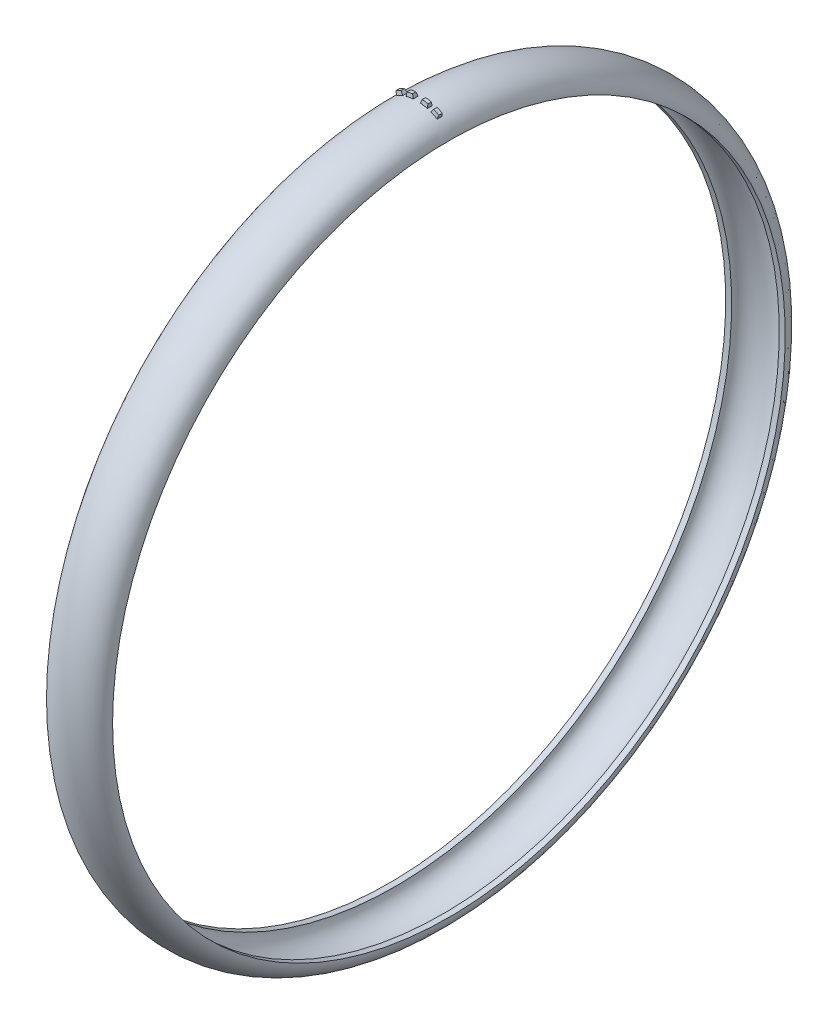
ISO-10303-21;
HEADER;
FILE_DESCRIPTION(('STEP AP214'),'2;1');
FILE_NAME('part.step','',(''),(''),'','','');
FILE_SCHEMA(('AUTOMOTIVE_DESIGN { 1 0 10303 214 1 1 1 1 }'));
ENDSEC;
DATA;
#1=APPLICATION_CONTEXT('core data for automotive mechanical design processes');
#2=APPLICATION_PROTOCOL_DEFINITION('international standard','automotive_design',2000,#1);
#3=PRODUCT_CONTEXT('',#1,'mechanical');
#4=PRODUCT('Part','Part','',(#3));
#5=PRODUCT_RELATED_PRODUCT_CATEGORY('part','',(#4));
#6=PRODUCT_DEFINITION_FORMATION('','',#4);
#7=PRODUCT_DEFINITION_CONTEXT('part definition',#1,'design');
#8=PRODUCT_DEFINITION('design','',#6,#7);
#9=PRODUCT_DEFINITION_SHAPE('','',#8);
#10=(LENGTH_UNIT() NAMED_UNIT(*) SI_UNIT(.MILLI.,.METRE.));
#11=(NAMED_UNIT(*) PLANE_ANGLE_UNIT() SI_UNIT($,.RADIAN.));
#12=(NAMED_UNIT(*) SI_UNIT($,.STERADIAN.) SOLID_ANGLE_UNIT());
#13=UNCERTAINTY_MEASURE_WITH_UNIT(LENGTH_MEASURE(1.E-05),#10,'distance_accuracy_value','');
#14=(GEOMETRIC_REPRESENTATION_CONTEXT(3) GLOBAL_UNCERTAINTY_ASSIGNED_CONTEXT((#13)) GLOBAL_UNIT_ASSIGNED_CONTEXT((#10,
#11,#12)) REPRESENTATION_CONTEXT('',''));
#15=CARTESIAN_POINT('',(0.,0.,0.));
#16=DIRECTION('',(0.,0.,1.));
#17=DIRECTION('',(1.,0.,0.));
#18=AXIS2_PLACEMENT_3D('',#15,#16,#17);
#19=CARTESIAN_POINT('',(0.,282.5,0.));
#20=DIRECTION('',(0.,0.,1.));
#21=DIRECTION('',(1.,0.,0.));
#22=AXIS2_PLACEMENT_3D('',#19,#20,#21);
#23=ELLIPSE('',#22,25.,17.5);
#24=CARTESIAN_POINT('',(0.,0.,0.));
#25=DIRECTION('',(-1.,0.,0.));
#26=AXIS1_PLACEMENT('',#24,#25);
#27=SURFACE_OF_REVOLUTION('',#23,#26);
#28=CARTESIAN_POINT('',(17.1116026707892,295.25154110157,-1.9999835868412));
#29=CARTESIAN_POINT('',(16.276009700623,295.800850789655,-2.00005429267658));
#30=CARTESIAN_POINT('',(15.4059383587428,296.296999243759,-2.00008393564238));
#31=CARTESIAN_POINT('',(13.6165432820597,297.189885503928,-2.00007545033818));
#32=CARTESIAN_POINT('',(12.6971774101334,297.586737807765,-2.00003736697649));
#33=CARTESIAN_POINT('',(11.7603573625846,297.936086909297,-1.999977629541));
#34=B_SPLINE_CURVE_WITH_KNOTS('',3,(#28,#29,#30,#31,#32,#33),.UNSPECIFIED.,.F.,.F.,(4,2,4),(0.,
0.5,1.),.UNSPECIFIED.);
#35=CARTESIAN_POINT('',(17.1118012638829,295.251936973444,-1.99998358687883));
#36=VERTEX_POINT('',#35);
#37=CARTESIAN_POINT('',(11.7605261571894,297.936423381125,-1.99997762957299));
#38=VERTEX_POINT('',#37);
#39=EDGE_CURVE('E13',#36,#38,#34,.T.);
#40=ORIENTED_EDGE('',*,*,#39,.F.);
#41=CARTESIAN_POINT('',(17.1116026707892,295.25154110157,1.99998358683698));
#42=CARTESIAN_POINT('',(17.1116026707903,295.260572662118,0.66668158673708));
#43=CARTESIAN_POINT('',(17.1116026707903,295.26057266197,-0.666681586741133));
#44=CARTESIAN_POINT('',(17.1116026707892,295.25154110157,-1.99998358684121));
#45=B_SPLINE_CURVE_WITH_KNOTS('',3,(#41,#42,#43,#44),.UNSPECIFIED.,.F.,.F.,(4,4),(0.,1.),.UNSPECIFIED.);
#46=CARTESIAN_POINT('',(17.1118056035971,295.251945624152,1.99998358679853));
#47=VERTEX_POINT('',#46);
#48=EDGE_CURVE('E478',#47,#36,#45,.T.);
#49=ORIENTED_EDGE('',*,*,#48,.F.);
#50=CARTESIAN_POINT('',(11.7603573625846,297.936086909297,1.99997762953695));
#51=CARTESIAN_POINT('',(12.6971832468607,297.586757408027,2.00003738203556));
#52=CARTESIAN_POINT('',(13.6165430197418,297.189886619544,2.00007545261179));
#53=CARTESIAN_POINT('',(15.4059384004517,296.297001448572,2.00008393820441));
#54=CARTESIAN_POINT('',(16.2760183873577,295.800859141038,2.00005430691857));
#55=CARTESIAN_POINT('',(17.1116026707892,295.25154110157,1.99998358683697));
#56=B_SPLINE_CURVE_WITH_KNOTS('',3,(#50,#51,#52,#53,#54,#55),.UNSPECIFIED.,.F.,.F.,(4,2,4),(0.,
0.5,1.),.UNSPECIFIED.);
#57=CARTESIAN_POINT('',(11.7605263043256,297.936423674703,1.99997762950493));
#58=VERTEX_POINT('',#57);
#59=EDGE_CURVE('E459',#58,#47,#56,.T.);
#60=ORIENTED_EDGE('',*,*,#59,.F.);
#61=CARTESIAN_POINT('',(11.7603573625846,0.,0.));
#62=DIRECTION('',(-1.,0.,0.));
#63=DIRECTION('',(0.,0.999977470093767,0.00671262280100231));
#64=AXIS2_PLACEMENT_3D('',#61,#62,#63);
#65=CIRCLE('',#64,297.942799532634);
#66=EDGE_CURVE('E347',#58,#38,#65,.T.);
#67=ORIENTED_EDGE('',*,*,#66,.T.);
#68=EDGE_LOOP('',(#40,#49,#60,#67));
#69=FACE_BOUND('',#68,.T.);
#70=CARTESIAN_POINT('',(8.90126085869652,298.846475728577,-1.99998463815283));
#71=CARTESIAN_POINT('',(6.96906179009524,299.362113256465,-2.0001016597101));
#72=CARTESIAN_POINT('',(4.98923335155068,299.699100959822,-2.00008829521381));
#73=CARTESIAN_POINT('',(2.99678574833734,299.867145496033,-1.99998152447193));
#74=B_SPLINE_CURVE_WITH_KNOTS('',3,(#70,#71,#72,#73),.UNSPECIFIED.,.F.,.F.,(4,4),(0.,1.),.UNSPECIFIED.);
#75=CARTESIAN_POINT('',(8.90133148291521,298.846884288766,-1.99998463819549));
#76=VERTEX_POINT('',#75);
#77=CARTESIAN_POINT('',(2.99685304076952,299.867534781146,-1.99998152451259));
#78=VERTEX_POINT('',#77);
#79=EDGE_CURVE('E361',#76,#78,#74,.T.);
#80=ORIENTED_EDGE('',*,*,#79,.F.);
#81=CARTESIAN_POINT('',(8.90126085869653,298.846475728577,1.99998463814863));
#82=CARTESIAN_POINT('',(8.90126085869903,298.85539865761,0.666681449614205));
#83=CARTESIAN_POINT('',(8.90126085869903,298.855398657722,-0.666681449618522));
#84=CARTESIAN_POINT('',(8.90126085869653,298.846475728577,-1.99998463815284));
#85=B_SPLINE_CURVE_WITH_KNOTS('',3,(#81,#82,#83,#84),.UNSPECIFIED.,.F.,.F.,(4,4),(0.,1.),.UNSPECIFIED.);
#86=CARTESIAN_POINT('',(8.90133394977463,298.846898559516,1.99998463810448));
#87=VERTEX_POINT('',#86);
#88=EDGE_CURVE('E527',#87,#76,#85,.T.);
#89=ORIENTED_EDGE('',*,*,#88,.F.);
#90=CARTESIAN_POINT('',(2.99678574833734,299.867145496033,1.99998152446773));
#91=CARTESIAN_POINT('',(4.98921855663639,299.699138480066,2.00008831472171));
#92=CARTESIAN_POINT('',(6.9690860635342,299.362135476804,2.00010167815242));
#93=CARTESIAN_POINT('',(8.90126085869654,298.846475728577,1.99998463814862));
#94=B_SPLINE_CURVE_WITH_KNOTS('',3,(#90,#91,#92,#93),.UNSPECIFIED.,.F.,.F.,(4,4),(0.,1.),.UNSPECIFIED.);
#95=CARTESIAN_POINT('',(2.99685340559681,299.867536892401,1.99998152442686));
#96=VERTEX_POINT('',#95);
#97=EDGE_CURVE('E538',#96,#87,#94,.T.);
#98=ORIENTED_EDGE('',*,*,#97,.F.);
#99=CARTESIAN_POINT('',(2.99678574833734,0.,0.));
#100=DIRECTION('',(-1.,0.,0.));
#101=DIRECTION('',(0.,0.999977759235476,0.00666941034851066));
#102=AXIS2_PLACEMENT_3D('',#99,#100,#101);
#103=CIRCLE('',#102,299.873814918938);
#104=EDGE_CURVE('E549',#96,#78,#103,.T.);
#105=ORIENTED_EDGE('',*,*,#104,.T.);
#106=EDGE_LOOP('',(#80,#89,#98,#105));
#107=FACE_BOUND('',#106,.T.);
#108=CARTESIAN_POINT('',(-17.1116027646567,295.251541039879,1.99998358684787));
#109=CARTESIAN_POINT('',(-16.2760100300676,295.80085101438,2.00005422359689));
#110=CARTESIAN_POINT('',(-15.4059384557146,296.296999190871,2.00008393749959));
#111=CARTESIAN_POINT('',(-13.6165433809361,297.189885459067,2.00007545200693));
#112=CARTESIAN_POINT('',(-12.6971775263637,297.586737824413,2.00003735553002));
#113=CARTESIAN_POINT('',(-11.7603574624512,297.936086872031,1.9999776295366));
#114=B_SPLINE_CURVE_WITH_KNOTS('',3,(#108,#109,#110,#111,#112,#113),.UNSPECIFIED.,.F.,.F.,(4,2,
4),(0.,0.5,1.),.UNSPECIFIED.);
#115=CARTESIAN_POINT('',(-17.111801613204,295.251937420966,1.99998358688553));
#116=VERTEX_POINT('',#115);
#117=CARTESIAN_POINT('',(-11.760531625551,297.936434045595,1.9999776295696));
#118=VERTEX_POINT('',#117);
#119=EDGE_CURVE('E634',#116,#118,#114,.T.);
#120=ORIENTED_EDGE('',*,*,#119,.F.);
#121=CARTESIAN_POINT('',(-17.1116027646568,0.,0.));
#122=DIRECTION('',(-1.,0.,0.));
#123=DIRECTION('',(0.,0.999977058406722,0.00677367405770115));
#124=AXIS2_PLACEMENT_3D('',#121,#122,#123);
#125=CIRCLE('',#124,295.258314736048);
#126=CARTESIAN_POINT('',(-17.1117992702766,295.251932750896,-1.99998358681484));
#127=VERTEX_POINT('',#126);
#128=EDGE_CURVE('E645',#116,#127,#125,.T.);
#129=ORIENTED_EDGE('',*,*,#128,.T.);
#130=CARTESIAN_POINT('',(-11.7603574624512,297.936086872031,-1.99997762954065));
#131=CARTESIAN_POINT('',(-12.6971833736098,297.586757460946,-2.00003736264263));
#132=CARTESIAN_POINT('',(-13.6165431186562,297.189886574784,-2.00007545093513));
#133=CARTESIAN_POINT('',(-15.405938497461,296.297001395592,-2.00008393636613));
#134=CARTESIAN_POINT('',(-16.276018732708,295.800859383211,-2.00005422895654));
#135=CARTESIAN_POINT('',(-17.1116027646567,295.251541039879,-1.99998358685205));
#136=B_SPLINE_CURVE_WITH_KNOTS('',3,(#130,#131,#132,#133,#134,#135),.UNSPECIFIED.,.F.,.F.,(4,2,
4),(0.,0.5,1.),.UNSPECIFIED.);
#137=CARTESIAN_POINT('',(-11.7605264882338,297.93642380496,-1.99997762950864));
#138=VERTEX_POINT('',#137);
#139=EDGE_CURVE('E611',#138,#127,#136,.T.);
#140=ORIENTED_EDGE('',*,*,#139,.F.);
#141=CARTESIAN_POINT('',(-11.7603574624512,297.936086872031,1.99997762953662));
#142=CARTESIAN_POINT('',(-11.7603574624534,297.945037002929,0.666679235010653));
#143=CARTESIAN_POINT('',(-11.7603574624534,297.945037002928,-0.666679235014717));
#144=CARTESIAN_POINT('',(-11.7603574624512,297.936086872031,-1.99997762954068));
#145=B_SPLINE_CURVE_WITH_KNOTS('',3,(#141,#142,#143,#144),.UNSPECIFIED.,.F.,.F.,(4,4),(0.,1.),.UNSPECIFIED.);
#146=EDGE_CURVE('E623',#118,#138,#145,.T.);
#147=ORIENTED_EDGE('',*,*,#146,.F.);
#148=EDGE_LOOP('',(#120,#129,#140,#147));
#149=FACE_BOUND('',#148,.T.);
#150=CARTESIAN_POINT('',(-25.,0.,0.));
#151=DIRECTION('',(-1.,0.,0.));
#152=DIRECTION('',(0.,0.,1.));
#153=AXIS2_PLACEMENT_3D('',#150,#151,#152);
#154=CIRCLE('',#153,282.5);
#155=CARTESIAN_POINT('',(-25.,0.,282.5));
#156=VERTEX_POINT('',#155);
#157=EDGE_CURVE('E646',#156,#156,#154,.T.);
#158=ORIENTED_EDGE('',*,*,#157,.F.);
#159=EDGE_LOOP('',(#158));
#160=FACE_BOUND('',#159,.T.);
#161=CARTESIAN_POINT('',(25.,0.,0.));
#162=DIRECTION('',(-1.,0.,0.));
#163=DIRECTION('',(0.,0.,1.));
#164=AXIS2_PLACEMENT_3D('',#161,#162,#163);
#165=CIRCLE('',#164,282.5);
#166=CARTESIAN_POINT('',(25.,0.,282.5));
#167=VERTEX_POINT('',#166);
#168=EDGE_CURVE('E655',#167,#167,#165,.T.);
#169=ORIENTED_EDGE('',*,*,#168,.T.);
#170=EDGE_LOOP('',(#169));
#171=FACE_BOUND('',#170,.T.);
#172=CARTESIAN_POINT('',(-8.90126096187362,298.846475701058,1.9999846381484));
#173=CARTESIAN_POINT('',(-6.96906192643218,299.362113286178,2.00010164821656));
#174=CARTESIAN_POINT('',(-4.98923336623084,299.699100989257,2.00008829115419));
#175=CARTESIAN_POINT('',(-2.99678577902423,299.867145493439,1.99998152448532));
#176=B_SPLINE_CURVE_WITH_KNOTS('',3,(#172,#173,#174,#175),.UNSPECIFIED.,.F.,.F.,(4,4),(0.,1.),.UNSPECIFIED.);
#177=CARTESIAN_POINT('',(-8.90133160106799,298.846884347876,1.99998463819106));
#178=VERTEX_POINT('',#177);
#179=CARTESIAN_POINT('',(-2.99685519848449,299.867547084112,1.99998152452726));
#180=VERTEX_POINT('',#179);
#181=EDGE_CURVE('E586',#178,#180,#176,.T.);
#182=ORIENTED_EDGE('',*,*,#181,.F.);
#183=CARTESIAN_POINT('',(-8.90126096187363,0.,0.));
#184=DIRECTION('',(-1.,0.,0.));
#185=DIRECTION('',(0.,0.999977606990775,0.00669219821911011));
#186=AXIS2_PLACEMENT_3D('',#183,#184,#185);
#187=CIRCLE('',#186,298.853167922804);
#188=CARTESIAN_POINT('',(-8.90133185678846,298.84688582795,-1.99998463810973));
#189=VERTEX_POINT('',#188);
#190=EDGE_CURVE('E597',#178,#189,#187,.T.);
#191=ORIENTED_EDGE('',*,*,#190,.T.);
#192=CARTESIAN_POINT('',(-2.99678577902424,299.867145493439,-1.99998152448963));
#193=CARTESIAN_POINT('',(-4.98921856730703,299.69913850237,-2.00008830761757));
#194=CARTESIAN_POINT('',(-6.96908620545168,299.362135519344,-2.0001016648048));
#195=CARTESIAN_POINT('',(-8.90126096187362,298.846475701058,-1.99998463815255));
#196=B_SPLINE_CURVE_WITH_KNOTS('',3,(#192,#193,#194,#195),.UNSPECIFIED.,.F.,.F.,(4,4),(0.,1.),.UNSPECIFIED.);
#197=CARTESIAN_POINT('',(-2.99685342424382,299.867536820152,-1.99998152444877));
#198=VERTEX_POINT('',#197);
#199=EDGE_CURVE('E563',#198,#189,#196,.T.);
#200=ORIENTED_EDGE('',*,*,#199,.F.);
#201=CARTESIAN_POINT('',(-2.99678577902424,299.867145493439,1.99998152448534));
#202=CARTESIAN_POINT('',(-2.99678577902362,299.876038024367,0.666680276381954));
#203=CARTESIAN_POINT('',(-2.99678577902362,299.876038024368,-0.666680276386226));
#204=CARTESIAN_POINT('',(-2.99678577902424,299.867145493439,-1.99998152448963));
#205=B_SPLINE_CURVE_WITH_KNOTS('',3,(#201,#202,#203,#204),.UNSPECIFIED.,.F.,.F.,(4,4),(0.,1.),.UNSPECIFIED.);
#206=EDGE_CURVE('E575',#180,#198,#205,.T.);
#207=ORIENTED_EDGE('',*,*,#206,.F.);
#208=EDGE_LOOP('',(#182,#191,#200,#207));
#209=FACE_BOUND('',#208,.T.);
#210=ADVANCED_FACE('F336',(#69,#107,#149,#160,#171,#209),#27,.T.);
#211=CARTESIAN_POINT('',(0.,0.,0.));
#212=DIRECTION('',(-1.,0.,0.));
#213=DIRECTION('',(0.,0.,1.));
#214=AXIS2_PLACEMENT_3D('',#211,#212,#213);
#215=CYLINDRICAL_SURFACE('',#214,282.5);
#216=CARTESIAN_POINT('',(-20.,0.,0.));
#217=DIRECTION('',(-1.,0.,0.));
#218=DIRECTION('',(0.,0.,1.));
#219=AXIS2_PLACEMENT_3D('',#216,#217,#218);
#220=CIRCLE('',#219,282.5);
#221=CARTESIAN_POINT('',(-20.,0.,282.5));
#222=VERTEX_POINT('',#221);
#223=EDGE_CURVE('E649',#222,#222,#220,.T.);
#224=ORIENTED_EDGE('',*,*,#223,.F.);
#225=EDGE_LOOP('',(#224));
#226=FACE_BOUND('',#225,.T.);
#227=ORIENTED_EDGE('',*,*,#157,.T.);
#228=EDGE_LOOP('',(#227));
#229=FACE_BOUND('',#228,.T.);
#230=ADVANCED_FACE('F672',(#226,#229),#215,.F.);
#231=CARTESIAN_POINT('',(-20.,282.5,0.));
#232=CARTESIAN_POINT('',(-20.,283.189271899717,0.));
#233=CARTESIAN_POINT('',(-19.8132546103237,284.529612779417,0.));
#234=CARTESIAN_POINT('',(-18.9138683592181,286.646759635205,0.));
#235=CARTESIAN_POINT('',(-17.2947349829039,288.787453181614,0.));
#236=CARTESIAN_POINT('',(-14.1376456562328,291.502957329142,0.));
#237=CARTESIAN_POINT('',(-8.44288129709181,294.209254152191,0.));
#238=CARTESIAN_POINT('',(0.,295.395372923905,0.));
#239=CARTESIAN_POINT('',(8.44288129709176,294.209254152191,0.));
#240=CARTESIAN_POINT('',(14.1376456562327,291.502957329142,0.));
#241=CARTESIAN_POINT('',(17.2947349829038,288.787453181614,0.));
#242=CARTESIAN_POINT('',(18.9138683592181,286.646759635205,0.));
#243=CARTESIAN_POINT('',(19.8132546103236,284.529612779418,0.));
#244=CARTESIAN_POINT('',(20.,283.189271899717,0.));
#245=CARTESIAN_POINT('',(20.,282.5,0.));
#246=B_SPLINE_CURVE_WITH_KNOTS('',3,(#231,#232,#233,#234,#235,#236,#237,#238,#239,#240,#241,
#242,#243,#244,#245),.UNSPECIFIED.,.F.,.F.,(4,1,1,1,1,1,1,1,1,1,1,1,4),(0.,0.196349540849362,
0.392699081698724,0.589048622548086,0.785398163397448,1.17809724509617,1.5707963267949,
1.96349540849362,2.35619449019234,2.55254403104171,2.74889357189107,2.94524311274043,
3.14159265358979),.UNSPECIFIED.);
#247=CARTESIAN_POINT('',(0.,0.,0.));
#248=DIRECTION('',(-1.,0.,0.));
#249=AXIS1_PLACEMENT('',#247,#248);
#250=SURFACE_OF_REVOLUTION('',#246,#249);
#251=CARTESIAN_POINT('',(20.,0.,0.));
#252=DIRECTION('',(-1.,0.,0.));
#253=DIRECTION('',(0.,0.,1.));
#254=AXIS2_PLACEMENT_3D('',#251,#252,#253);
#255=CIRCLE('',#254,282.5);
#256=CARTESIAN_POINT('',(20.,0.,282.5));
#257=VERTEX_POINT('',#256);
#258=EDGE_CURVE('E652',#257,#257,#255,.T.);
#259=ORIENTED_EDGE('',*,*,#258,.F.);
#260=EDGE_LOOP('',(#259));
#261=FACE_BOUND('',#260,.T.);
#262=ORIENTED_EDGE('',*,*,#223,.T.);
#263=EDGE_LOOP('',(#262));
#264=FACE_BOUND('',#263,.T.);
#265=ADVANCED_FACE('F668',(#261,#264),#250,.T.);
#266=CARTESIAN_POINT('',(0.,0.,0.));
#267=DIRECTION('',(-1.,0.,0.));
#268=DIRECTION('',(0.,0.,1.));
#269=AXIS2_PLACEMENT_3D('',#266,#267,#268);
#270=CYLINDRICAL_SURFACE('',#269,282.5);
#271=ORIENTED_EDGE('',*,*,#168,.F.);
#272=EDGE_LOOP('',(#271));
#273=FACE_BOUND('',#272,.T.);
#274=ORIENTED_EDGE('',*,*,#258,.T.);
#275=EDGE_LOOP('',(#274));
#276=FACE_BOUND('',#275,.T.);
#277=ADVANCED_FACE('F671',(#273,#276),#270,.F.);
#278=CARTESIAN_POINT('',(-18.5076246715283,297.900722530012,2.04008187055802));
#279=CARTESIAN_POINT('',(-18.5089398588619,297.903344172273,1.22404818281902));
#280=CARTESIAN_POINT('',(-18.5117549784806,297.908955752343,0.408014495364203));
#281=CARTESIAN_POINT('',(-18.511758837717,297.908963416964,-0.40801919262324));
#282=CARTESIAN_POINT('',(-18.5089406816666,297.903345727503,-1.22405288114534));
#283=CARTESIAN_POINT('',(-18.507614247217,297.900701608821,-2.04008656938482));
#284=CARTESIAN_POINT('',(-17.4789250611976,298.57523148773,2.04008186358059));
#285=CARTESIAN_POINT('',(-17.4730020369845,298.563424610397,1.22404817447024));
#286=CARTESIAN_POINT('',(-17.4688959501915,298.555239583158,0.40801448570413));
#287=CARTESIAN_POINT('',(-17.4689117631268,298.555271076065,-0.408019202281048));
#288=CARTESIAN_POINT('',(-17.4730647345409,298.563549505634,-1.2240528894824));
#289=CARTESIAN_POINT('',(-17.479028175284,298.575436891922,-2.04008657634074));
#290=CARTESIAN_POINT('',(-16.4193629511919,299.188219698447,2.04008185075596));
#291=CARTESIAN_POINT('',(-16.4067877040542,299.163152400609,1.22404816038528));
#292=CARTESIAN_POINT('',(-16.3993302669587,299.14828685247,0.408014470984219));
#293=CARTESIAN_POINT('',(-16.3993343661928,299.148294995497,-0.408019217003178));
#294=CARTESIAN_POINT('',(-16.4067909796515,299.163158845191,-1.22405290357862));
#295=CARTESIAN_POINT('',(-16.4193640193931,299.188221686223,-2.04008658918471));
#296=CARTESIAN_POINT('',(-15.3235836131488,299.729013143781,2.04008183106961));
#297=CARTESIAN_POINT('',(-15.3117902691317,299.705504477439,1.22404814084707));
#298=CARTESIAN_POINT('',(-15.3048191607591,299.691608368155,0.408014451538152));
#299=CARTESIAN_POINT('',(-15.3048179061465,299.691605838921,-0.40801923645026));
#300=CARTESIAN_POINT('',(-15.3117456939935,299.705415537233,-1.2240529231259));
#301=CARTESIAN_POINT('',(-15.3234839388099,299.728814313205,-2.04008660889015));
#302=CARTESIAN_POINT('',(-14.1980667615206,300.210528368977,2.0400818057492));
#303=CARTESIAN_POINT('',(-14.1928628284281,300.200154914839,1.22404811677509));
#304=CARTESIAN_POINT('',(-14.1892934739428,300.193039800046,0.408014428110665));
#305=CARTESIAN_POINT('',(-14.1892975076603,300.193047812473,-0.408019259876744));
#306=CARTESIAN_POINT('',(-14.1928863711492,300.200201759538,-1.22405294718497));
#307=CARTESIAN_POINT('',(-14.1981011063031,300.210596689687,-2.04008663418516));
#308=CARTESIAN_POINT('',(-13.0466073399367,300.640330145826,2.04008177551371));
#309=CARTESIAN_POINT('',(-13.0481991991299,300.643503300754,1.22404808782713));
#310=CARTESIAN_POINT('',(-13.051029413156,300.649144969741,0.408014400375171));
#311=CARTESIAN_POINT('',(-13.0510375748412,300.649161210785,-0.408019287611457));
#312=CARTESIAN_POINT('',(-13.0482068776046,300.643518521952,-1.22405297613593));
#313=CARTESIAN_POINT('',(-13.0465939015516,300.640303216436,-2.0400866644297));
#314=B_SPLINE_SURFACE_WITH_KNOTS('',5,5,((#278,#279,#280,#281,#282,#283),(#284,#285,#286,#287,
#288,#289),(#290,#291,#292,#293,#294,#295),(#296,#297,#298,#299,#300,#301),(#302,#303,#304,#305,
#306,#307),(#308,#309,#310,#311,#312,#313)),.UNSPECIFIED.,.F.,.F.,.F.,(6,6),(6,6),
(-3.05424408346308,3.05543350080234),(-2.04008182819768,2.04008661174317),.UNSPECIFIED.);
#315=CARTESIAN_POINT('',(-13.6594132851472,300.401713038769,1.41731945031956));
#316=CARTESIAN_POINT('',(-13.6583170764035,300.401416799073,1.18110325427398));
#317=CARTESIAN_POINT('',(-13.6575259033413,300.401234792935,0.94488575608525));
#318=CARTESIAN_POINT('',(-13.6564920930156,300.401019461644,0.47245069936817));
#319=CARTESIAN_POINT('',(-13.6562494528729,300.400986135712,0.236233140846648));
#320=CARTESIAN_POINT('',(-13.6562511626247,300.400988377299,-0.236207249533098));
#321=CARTESIAN_POINT('',(-13.6564955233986,300.401023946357,-0.472430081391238));
#322=CARTESIAN_POINT('',(-13.6575310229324,300.401241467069,-0.944875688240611));
#323=CARTESIAN_POINT('',(-13.6583221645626,300.401423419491,-1.18109846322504));
#324=CARTESIAN_POINT('',(-13.6594165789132,300.401717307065,-1.41731994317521));
#325=B_SPLINE_CURVE_WITH_KNOTS('',3,(#315,#316,#317,#318,#319,#320,#321,#322,#323,#324),
.UNSPECIFIED.,.F.,.F.,(4,2,2,2,4),(0.,0.70865616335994,1.41730860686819,2.12597688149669,
2.83464887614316),.UNSPECIFIED.);
#326=CARTESIAN_POINT('',(-13.6594132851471,300.401713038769,1.41731945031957));
#327=VERTEX_POINT('',#326);
#328=CARTESIAN_POINT('',(-13.6594165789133,300.401717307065,-1.41731994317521));
#329=VERTEX_POINT('',#328);
#330=EDGE_CURVE('E781',#327,#329,#325,.T.);
#331=CARTESIAN_POINT('',(-13.6594165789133,300.401717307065,-1.41731994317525));
#332=CARTESIAN_POINT('',(-14.029464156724,300.251365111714,-1.41804768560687));
#333=CARTESIAN_POINT('',(-14.3968212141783,300.094306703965,-1.41857172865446));
#334=CARTESIAN_POINT('',(-15.1246295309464,299.76646892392,-1.41926550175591));
#335=CARTESIAN_POINT('',(-15.485091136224,299.595712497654,-1.41943581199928));
#336=CARTESIAN_POINT('',(-16.201101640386,299.238534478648,-1.41947737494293));
#337=CARTESIAN_POINT('',(-16.5566039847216,299.052019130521,-1.41934669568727));
#338=CARTESIAN_POINT('',(-17.0839069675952,298.760833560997,-1.41887939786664));
#339=CARTESIAN_POINT('',(-17.2588289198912,298.661780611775,-1.41867813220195));
#340=CARTESIAN_POINT('',(-17.6065002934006,298.459925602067,-1.41816448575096));
#341=CARTESIAN_POINT('',(-17.7792496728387,298.357123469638,-1.41785210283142));
#342=CARTESIAN_POINT('',(-17.9508683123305,298.252455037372,-1.41747392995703));
#343=B_SPLINE_CURVE_WITH_KNOTS('',3,(#331,#332,#333,#334,#335,#336,#337,#338,#339,#340,#341,
#342),.UNSPECIFIED.,.F.,.F.,(4,2,2,2,2,4),(0.,1.1982572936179,2.39454765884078,3.59853801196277,
4.20155850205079,4.80459056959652),.UNSPECIFIED.);
#344=CARTESIAN_POINT('',(-17.9508683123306,298.252455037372,-1.41747392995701));
#345=VERTEX_POINT('',#344);
#346=EDGE_CURVE('E753',#329,#345,#343,.T.);
#347=CARTESIAN_POINT('',(-17.9508683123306,298.252455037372,-1.41747392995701));
#348=CARTESIAN_POINT('',(-17.9503448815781,298.251719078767,-1.18122991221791));
#349=CARTESIAN_POINT('',(-17.9499639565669,298.251208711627,-0.944985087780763));
#350=CARTESIAN_POINT('',(-17.9494632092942,298.250553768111,-0.472495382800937));
#351=CARTESIAN_POINT('',(-17.9493433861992,298.250409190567,-0.236250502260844));
#352=CARTESIAN_POINT('',(-17.949340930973,298.250400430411,0.236242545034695));
#353=CARTESIAN_POINT('',(-17.949458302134,298.25053625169,0.472490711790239));
#354=CARTESIAN_POINT('',(-17.9499544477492,298.251174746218,0.944987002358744));
#355=CARTESIAN_POINT('',(-17.9503332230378,298.251677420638,1.18123512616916));
#356=CARTESIAN_POINT('',(-17.9508548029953,298.252406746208,1.41748244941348));
#357=B_SPLINE_CURVE_WITH_KNOTS('',3,(#347,#348,#349,#350,#351,#352,#353,#354,#355,#356),
.UNSPECIFIED.,.F.,.F.,(4,2,2,2,4),(0.,0.708736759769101,1.41747125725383,2.1262155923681,
2.83496218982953),.UNSPECIFIED.);
#358=CARTESIAN_POINT('',(-17.9508548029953,298.252406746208,1.41748244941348));
#359=VERTEX_POINT('',#358);
#360=EDGE_CURVE('E658',#345,#359,#357,.T.);
#361=CARTESIAN_POINT('',(-17.9508548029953,298.252406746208,1.41748244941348));
#362=CARTESIAN_POINT('',(-17.7803583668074,298.35638086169,1.41785965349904));
#363=CARTESIAN_POINT('',(-17.6087494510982,298.458518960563,1.41817071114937));
#364=CARTESIAN_POINT('',(-17.2633906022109,298.659102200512,1.41868158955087));
#365=CARTESIAN_POINT('',(-17.089640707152,298.757547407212,1.41888141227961));
#366=CARTESIAN_POINT('',(-16.565887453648,299.046991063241,1.41934510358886));
#367=CARTESIAN_POINT('',(-16.2128033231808,299.232449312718,1.41947432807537));
#368=CARTESIAN_POINT('',(-15.4969939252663,299.59003298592,1.41943645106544));
#369=CARTESIAN_POINT('',(-15.1342196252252,299.762059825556,1.41926734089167));
#370=CARTESIAN_POINT('',(-14.4016834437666,300.092243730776,1.4185740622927));
#371=CARTESIAN_POINT('',(-14.0319109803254,300.250377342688,1.41804930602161));
#372=CARTESIAN_POINT('',(-13.6594132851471,300.401713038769,1.41731945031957));
#373=B_SPLINE_CURVE_WITH_KNOTS('',3,(#361,#362,#363,#364,#365,#366,#367,#368,#369,#370,#371,
#372),.UNSPECIFIED.,.F.,.F.,(4,2,2,2,2,4),(0.,0.599074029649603,1.19813740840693,
2.39423800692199,3.5984226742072,4.80460260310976),.UNSPECIFIED.);
#374=EDGE_CURVE('E758',#359,#327,#373,.T.);
#375=ORIENTED_EDGE('',*,*,#330,.T.);
#376=ORIENTED_EDGE('',*,*,#346,.T.);
#377=ORIENTED_EDGE('',*,*,#360,.T.);
#378=ORIENTED_EDGE('',*,*,#374,.T.);
#379=EDGE_LOOP('',(#375,#376,#377,#378));
#380=FACE_BOUND('',#379,.T.);
#381=ADVANCED_FACE('F689',(#380),#314,.T.);
#382=CARTESIAN_POINT('',(-11.7603520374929,297.936076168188,-1.9999799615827));
#383=CARTESIAN_POINT('',(-12.6971779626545,297.586746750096,-2.00003969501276));
#384=CARTESIAN_POINT('',(-13.6165377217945,297.189875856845,-2.00007778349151));
#385=CARTESIAN_POINT('',(-15.405933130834,296.296990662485,-2.00008626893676));
#386=CARTESIAN_POINT('',(-16.2760133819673,295.800848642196,-2.00005656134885));
#387=CARTESIAN_POINT('',(-17.1115974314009,295.251530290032,-1.99998591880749));
#388=CARTESIAN_POINT('',(-13.062689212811,300.505683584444,-1.44014062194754));
#389=CARTESIAN_POINT('',(-13.99615353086,300.158036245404,-1.44012159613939));
#390=CARTESIAN_POINT('',(-14.9121299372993,299.762867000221,-1.44011497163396));
#391=CARTESIAN_POINT('',(-16.6942670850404,298.873623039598,-1.44012003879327));
#392=CARTESIAN_POINT('',(-17.5605335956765,298.379379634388,-1.44013313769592));
#393=CARTESIAN_POINT('',(-18.3919201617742,297.832181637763,-1.44016737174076));
#394=CARTESIAN_POINT('',(-13.1238819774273,300.62642142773,-1.4138355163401));
#395=CARTESIAN_POINT('',(-14.0571883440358,300.278853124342,-1.41381278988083));
#396=CARTESIAN_POINT('',(-14.9730057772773,299.883763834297,-1.41380406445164));
#397=CARTESIAN_POINT('',(-16.7548018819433,298.994690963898,-1.41380897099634));
#398=CARTESIAN_POINT('',(-17.6208891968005,298.500536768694,-1.41382408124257));
#399=CARTESIAN_POINT('',(-18.4520785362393,297.953438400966,-1.4138632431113));
#400=B_SPLINE_SURFACE_WITH_KNOTS('',1,3,((#382,#383,#384,#385,#386,#387),(#388,#389,#390,#391,
#392,#393),(#394,#395,#396,#397,#398,#399)),.UNSPECIFIED.,.F.,.F.,.F.,(2,1,2),(4,2,4),(0.,1.,
1.04698688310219),(0.,0.5,1.),.UNSPECIFIED.);
#401=CARTESIAN_POINT('',(-11.7605756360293,297.936370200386,-1.99991080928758));
#402=CARTESIAN_POINT('',(-11.9188001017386,298.141846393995,-1.95145122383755));
#403=CARTESIAN_POINT('',(-12.0770276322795,298.347314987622,-1.90296941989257));
#404=CARTESIAN_POINT('',(-12.3934888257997,298.758236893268,-1.80596108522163));
#405=CARTESIAN_POINT('',(-12.5517224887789,298.963690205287,-1.75743455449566));
#406=CARTESIAN_POINT('',(-12.8681959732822,299.374581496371,-1.66033646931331));
#407=CARTESIAN_POINT('',(-13.0264357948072,299.580019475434,-1.61176491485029));
#408=CARTESIAN_POINT('',(-13.3429215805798,299.990879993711,-1.51457648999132));
#409=CARTESIAN_POINT('',(-13.5011675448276,300.196302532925,-1.46595961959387));
#410=CARTESIAN_POINT('',(-13.6594165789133,300.401717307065,-1.41731994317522));
#411=B_SPLINE_CURVE_WITH_KNOTS('',3,(#401,#402,#403,#404,#405,#406,#407,#408,#409,#410),
.UNSPECIFIED.,.F.,.F.,(4,2,2,2,4),(0.,0.791475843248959,1.58295168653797,2.37442764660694,
3.16590363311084),.UNSPECIFIED.);
#412=EDGE_CURVE('E816',#138,#329,#411,.T.);
#413=CARTESIAN_POINT('',(-17.1117147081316,295.251941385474,-1.99990606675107));
#414=CARTESIAN_POINT('',(-17.1816376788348,295.502008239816,-1.95148486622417));
#415=CARTESIAN_POINT('',(-17.2515622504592,295.752069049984,-1.90303476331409));
#416=CARTESIAN_POINT('',(-17.3914146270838,296.252178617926,-1.80607705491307));
#417=CARTESIAN_POINT('',(-17.4613424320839,296.502227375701,-1.75756944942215));
#418=CARTESIAN_POINT('',(-17.6012013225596,297.002312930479,-1.66049702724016));
#419=CARTESIAN_POINT('',(-17.671132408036,297.252349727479,-1.61193221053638));
#420=CARTESIAN_POINT('',(-17.8109978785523,297.752411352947,-1.51474567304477));
#421=CARTESIAN_POINT('',(-17.8809322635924,298.002436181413,-1.46612395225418));
#422=CARTESIAN_POINT('',(-17.9508683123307,298.252455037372,-1.41747392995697));
#423=B_SPLINE_CURVE_WITH_KNOTS('',3,(#413,#414,#415,#416,#417,#418,#419,#420,#421,#422),
.UNSPECIFIED.,.F.,.F.,(4,2,2,2,4),(0.,0.792404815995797,1.58480963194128,2.37721462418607,
3.16961965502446),.UNSPECIFIED.);
#424=EDGE_CURVE('E788',#127,#345,#423,.T.);
#425=ORIENTED_EDGE('',*,*,#346,.F.);
#426=ORIENTED_EDGE('',*,*,#412,.F.);
#427=ORIENTED_EDGE('',*,*,#139,.T.);
#428=ORIENTED_EDGE('',*,*,#424,.T.);
#429=EDGE_LOOP('',(#425,#426,#427,#428));
#430=FACE_BOUND('',#429,.T.);
#431=ADVANCED_FACE('F696',(#430),#400,.F.);
#432=CARTESIAN_POINT('',(-11.7603499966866,297.936077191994,1.99997763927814));
#433=CARTESIAN_POINT('',(-11.7603499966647,297.945027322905,0.666679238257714));
#434=CARTESIAN_POINT('',(-11.7603499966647,297.945027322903,-0.666679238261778));
#435=CARTESIAN_POINT('',(-11.7603499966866,297.936077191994,-1.9999776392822));
#436=CARTESIAN_POINT('',(-13.5566903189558,300.265194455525,1.99763372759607));
#437=CARTESIAN_POINT('',(-13.5566961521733,300.27414166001,0.665897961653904));
#438=CARTESIAN_POINT('',(-13.5566961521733,300.274141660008,-0.665897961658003));
#439=CARTESIAN_POINT('',(-13.5566903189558,300.265194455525,-1.99763372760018));
#440=CARTESIAN_POINT('',(-13.670808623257,300.413159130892,1.99748482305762));
#441=CARTESIAN_POINT('',(-13.6708148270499,300.422106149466,0.665848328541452));
#442=CARTESIAN_POINT('',(-13.6708148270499,300.422106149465,-0.665848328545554));
#443=CARTESIAN_POINT('',(-13.670808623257,300.413159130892,-1.99748482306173));
#444=B_SPLINE_SURFACE_WITH_KNOTS('',1,3,((#432,#433,#434,#435),(#436,#437,#438,#439),(#440,#441,
#442,#443)),.UNSPECIFIED.,.F.,.F.,.F.,(2,1,2),(4,4),(0.,1.,1.06352822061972),(0.,1.),.UNSPECIFIED.);
#445=CARTESIAN_POINT('',(-11.7605822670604,297.936378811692,1.99990877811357));
#446=CARTESIAN_POINT('',(-11.9188058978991,298.14185392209,1.95144925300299));
#447=CARTESIAN_POINT('',(-12.0770325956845,298.347321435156,1.90296752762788));
#448=CARTESIAN_POINT('',(-12.3934921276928,298.75824118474,1.80595938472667));
#449=CARTESIAN_POINT('',(-12.5517249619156,298.96369342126,1.75743296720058));
#450=CARTESIAN_POINT('',(-12.8681967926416,299.374582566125,1.66033514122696));
#451=CARTESIAN_POINT('',(-13.0264357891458,299.580019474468,1.61176373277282));
#452=CARTESIAN_POINT('',(-13.3429199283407,299.990877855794,1.51457563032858));
#453=CARTESIAN_POINT('',(-13.5011650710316,300.196299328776,1.46595893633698));
#454=CARTESIAN_POINT('',(-13.6594132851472,300.401713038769,1.41731945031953));
#455=B_SPLINE_CURVE_WITH_KNOTS('',3,(#445,#446,#447,#448,#449,#450,#451,#452,#453,#454),
.UNSPECIFIED.,.F.,.F.,(4,2,2,2,4),(0.,0.791471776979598,1.58294355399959,2.37441544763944,
3.16588736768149),.UNSPECIFIED.);
#456=EDGE_CURVE('E787',#118,#327,#455,.T.);
#457=ORIENTED_EDGE('',*,*,#330,.F.);
#458=ORIENTED_EDGE('',*,*,#456,.F.);
#459=ORIENTED_EDGE('',*,*,#146,.T.);
#460=ORIENTED_EDGE('',*,*,#412,.T.);
#461=EDGE_LOOP('',(#457,#458,#459,#460));
#462=FACE_BOUND('',#461,.T.);
#463=ADVANCED_FACE('F712',(#462),#444,.F.);
#464=CARTESIAN_POINT('',(-17.111597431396,295.251530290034,1.99998591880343));
#465=CARTESIAN_POINT('',(-16.2760046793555,295.800840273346,2.00005655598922));
#466=CARTESIAN_POINT('',(-15.4059330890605,296.296988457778,2.00008627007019));
#467=CARTESIAN_POINT('',(-13.6165379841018,297.189874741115,2.00007778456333));
#468=CARTESIAN_POINT('',(-12.6971721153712,297.586727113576,2.00003968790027));
#469=CARTESIAN_POINT('',(-11.7603520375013,297.936076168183,1.99997996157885));
#470=CARTESIAN_POINT('',(-18.3919309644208,297.832200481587,1.44016312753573));
#471=CARTESIAN_POINT('',(-17.56052768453,298.379395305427,1.44012891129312));
#472=CARTESIAN_POINT('',(-16.6942832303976,298.873636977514,1.44011582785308));
#473=CARTESIAN_POINT('',(-14.9121333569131,299.762888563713,1.44011075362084));
#474=CARTESIAN_POINT('',(-13.9961663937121,300.158032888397,1.44011734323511));
#475=CARTESIAN_POINT('',(-13.062697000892,300.505703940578,1.44013635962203));
#476=CARTESIAN_POINT('',(-18.4520807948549,297.953439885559,1.41386275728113));
#477=CARTESIAN_POINT('',(-17.6208743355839,298.500535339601,1.41382361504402));
#478=CARTESIAN_POINT('',(-16.7548096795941,298.994687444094,1.41380852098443));
#479=CARTESIAN_POINT('',(-14.9730001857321,299.8837682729,1.41380360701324));
#480=CARTESIAN_POINT('',(-14.0571929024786,300.278832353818,1.41381229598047));
#481=CARTESIAN_POINT('',(-13.1238809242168,300.626424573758,1.41383501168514));
#482=B_SPLINE_SURFACE_WITH_KNOTS('',1,3,((#464,#465,#466,#467,#468,#469),(#470,#471,#472,#473,
#474,#475),(#476,#477,#478,#479,#480,#481)),.UNSPECIFIED.,.F.,.F.,.F.,(2,1,2),(4,2,4),(0.,1.,
1.04697981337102),(0.,0.5,1.),.UNSPECIFIED.);
#483=CARTESIAN_POINT('',(-17.1117160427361,295.251946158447,1.99990514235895));
#484=CARTESIAN_POINT('',(-17.1816377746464,295.502008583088,1.95148468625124));
#485=CARTESIAN_POINT('',(-17.2515611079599,295.752064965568,1.90303533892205));
#486=CARTESIAN_POINT('',(-17.3914110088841,296.252165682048,1.80607916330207));
#487=CARTESIAN_POINT('',(-17.4613375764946,296.502210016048,1.75757233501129));
#488=CARTESIAN_POINT('',(-17.6011939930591,297.002286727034,1.66050148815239));
#489=CARTESIAN_POINT('',(-17.6711238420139,297.252319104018,1.61193746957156));
#490=CARTESIAN_POINT('',(-17.8109868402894,297.752371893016,1.51475254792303));
#491=CARTESIAN_POINT('',(-17.8809199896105,298.002392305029,1.46613164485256));
#492=CARTESIAN_POINT('',(-17.9508548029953,298.252406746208,1.4174824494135));
#493=B_SPLINE_CURVE_WITH_KNOTS('',3,(#483,#484,#485,#486,#487,#488,#489,#490,#491,#492),
.UNSPECIFIED.,.F.,.F.,(4,2,2,2,4),(0.,0.792390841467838,1.58478168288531,2.37717270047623,
3.16956375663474),.UNSPECIFIED.);
#494=EDGE_CURVE('E752',#116,#359,#493,.T.);
#495=ORIENTED_EDGE('',*,*,#374,.F.);
#496=ORIENTED_EDGE('',*,*,#494,.F.);
#497=ORIENTED_EDGE('',*,*,#119,.T.);
#498=ORIENTED_EDGE('',*,*,#456,.T.);
#499=EDGE_LOOP('',(#495,#496,#497,#498));
#500=FACE_BOUND('',#499,.T.);
#501=ADVANCED_FACE('F702',(#500),#482,.F.);
#502=CARTESIAN_POINT('',(-17.1115994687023,295.251529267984,-1.99998358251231));
#503=CARTESIAN_POINT('',(-17.1115994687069,295.260560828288,-0.666681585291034));
#504=CARTESIAN_POINT('',(-17.1115994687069,295.260560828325,0.666681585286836));
#505=CARTESIAN_POINT('',(-17.1115994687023,295.251529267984,1.99998358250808));
#506=CARTESIAN_POINT('',(-17.9046505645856,298.08400603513,-2.00102778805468));
#507=CARTESIAN_POINT('',(-17.9046494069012,298.093038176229,-0.667029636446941));
#508=CARTESIAN_POINT('',(-17.9046494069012,298.093038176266,0.6670296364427));
#509=CARTESIAN_POINT('',(-17.9046505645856,298.08400603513,2.0010277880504));
#510=CARTESIAN_POINT('',(-17.9559043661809,298.267065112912,-2.00109527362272));
#511=CARTESIAN_POINT('',(-17.9559031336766,298.276097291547,-0.667052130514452));
#512=CARTESIAN_POINT('',(-17.9559031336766,298.276097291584,0.667052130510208));
#513=CARTESIAN_POINT('',(-17.9559043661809,298.267065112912,2.00109527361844));
#514=B_SPLINE_SURFACE_WITH_KNOTS('',1,3,((#502,#503,#504,#505),(#506,#507,#508,#509),(#510,#511,
#512,#513)),.UNSPECIFIED.,.F.,.F.,.F.,(2,1,2),(4,4),(0.,1.,1.06462862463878),(0.,1.),.UNSPECIFIED.);
#515=ORIENTED_EDGE('',*,*,#360,.F.);
#516=ORIENTED_EDGE('',*,*,#424,.F.);
#517=ORIENTED_EDGE('',*,*,#128,.F.);
#518=ORIENTED_EDGE('',*,*,#494,.T.);
#519=EDGE_LOOP('',(#515,#516,#517,#518));
#520=FACE_BOUND('',#519,.T.);
#521=ADVANCED_FACE('F690',(#520),#514,.F.);
#522=CARTESIAN_POINT('',(-9.47054844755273,301.787905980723,2.04006916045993));
#523=CARTESIAN_POINT('',(-9.47120273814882,301.791691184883,1.22404146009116));
#524=CARTESIAN_POINT('',(-9.47219805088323,301.797449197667,0.408013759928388));
#525=CARTESIAN_POINT('',(-9.47219771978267,301.797447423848,-0.408013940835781));
#526=CARTESIAN_POINT('',(-9.47120226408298,301.791688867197,-1.22404164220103));
#527=CARTESIAN_POINT('',(-9.47054855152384,301.787907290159,-2.04006934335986));
#528=CARTESIAN_POINT('',(-8.28423055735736,302.102741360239,2.04006920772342));
#529=CARTESIAN_POINT('',(-8.28274829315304,302.094166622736,1.22404150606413));
#530=CARTESIAN_POINT('',(-8.28168379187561,302.088008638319,0.408013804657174));
#531=CARTESIAN_POINT('',(-8.28168444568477,302.088012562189,-0.4080138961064));
#532=CARTESIAN_POINT('',(-8.28275207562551,302.094188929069,-1.2240415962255));
#533=CARTESIAN_POINT('',(-8.28423767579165,302.102783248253,-2.04006929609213));
#534=CARTESIAN_POINT('',(-7.08951206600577,302.368979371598,2.04006924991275));
#535=CARTESIAN_POINT('',(-7.08590529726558,302.348114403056,1.2240415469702));
#536=CARTESIAN_POINT('',(-7.08374420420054,302.335612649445,0.408013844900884));
#537=CARTESIAN_POINT('',(-7.08374393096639,302.335611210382,-0.408013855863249));
#538=CARTESIAN_POINT('',(-7.08590382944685,302.348106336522,-1.22404155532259));
#539=CARTESIAN_POINT('',(-7.0895082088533,302.368957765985,-2.04006925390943));
#540=CARTESIAN_POINT('',(-5.88430364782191,302.574533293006,2.04006928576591));
#541=CARTESIAN_POINT('',(-5.88082108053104,302.554386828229,1.22404158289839));
#542=CARTESIAN_POINT('',(-5.87873339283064,302.542309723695,0.408013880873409));
#543=CARTESIAN_POINT('',(-5.87873452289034,302.542316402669,-0.408013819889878));
#544=CARTESIAN_POINT('',(-5.88081899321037,302.554375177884,-1.22404151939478));
#545=CARTESIAN_POINT('',(-5.88429753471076,302.574498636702,-2.04006921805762));
#546=CARTESIAN_POINT('',(-4.66951735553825,302.724679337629,2.04006931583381));
#547=CARTESIAN_POINT('',(-4.66811195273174,302.71654924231,1.22404161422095));
#548=CARTESIAN_POINT('',(-4.66710975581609,302.710751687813,0.408013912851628));
#549=CARTESIAN_POINT('',(-4.66711200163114,302.710764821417,-0.408013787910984));
#550=CARTESIAN_POINT('',(-4.66811887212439,302.716589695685,-1.22404148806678));
#551=CARTESIAN_POINT('',(-4.66952583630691,302.724729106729,-2.04006918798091));
#552=CARTESIAN_POINT('',(-3.44684550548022,302.829207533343,2.04006934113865));
#553=CARTESIAN_POINT('',(-3.44752462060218,302.833136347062,1.22404164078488));
#554=CARTESIAN_POINT('',(-3.44852160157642,302.838904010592,0.408013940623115));
#555=CARTESIAN_POINT('',(-3.4485242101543,302.838919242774,-0.408013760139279));
#556=CARTESIAN_POINT('',(-3.44752647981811,302.833147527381,-1.2240414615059));
#557=CARTESIAN_POINT('',(-3.44684092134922,302.82918172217,-2.04006916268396));
#558=B_SPLINE_SURFACE_WITH_KNOTS('',5,5,((#522,#523,#524,#525,#526,#527),(#528,#529,#530,#531,
#532,#533),(#534,#535,#536,#537,#538,#539),(#540,#541,#542,#543,#544,#545),(#546,#547,#548,#549,
#550,#551),(#552,#553,#554,#555,#556,#557)),.UNSPECIFIED.,.F.,.F.,.F.,(6,6),(6,6),
(-3.05630923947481,3.05673468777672),(-2.04006925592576,2.04006924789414),.UNSPECIFIED.);
#559=CARTESIAN_POINT('',(-4.09746575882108,302.766891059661,1.41714307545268));
#560=CARTESIAN_POINT('',(-4.09694193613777,302.766629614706,1.18095353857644));
#561=CARTESIAN_POINT('',(-4.09656416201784,302.766473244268,0.944763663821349));
#562=CARTESIAN_POINT('',(-4.09607080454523,302.766291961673,0.472383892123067));
#563=CARTESIAN_POINT('',(-4.09595522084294,302.76626704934,0.236193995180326));
#564=CARTESIAN_POINT('',(-4.09595633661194,302.766269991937,-0.236187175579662));
#565=CARTESIAN_POINT('',(-4.09607303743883,302.766297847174,-0.472378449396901));
#566=CARTESIAN_POINT('',(-4.09656776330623,302.766482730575,-0.944760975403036));
#567=CARTESIAN_POINT('',(-4.09694578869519,302.76663975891,-1.18095222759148));
#568=CARTESIAN_POINT('',(-4.09746899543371,302.76689957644,-1.41714314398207));
#569=B_SPLINE_CURVE_WITH_KNOTS('',3,(#559,#560,#561,#562,#563,#564,#565,#566,#567,#568),
.UNSPECIFIED.,.F.,.F.,(4,2,2,2,4),(0.,0.708570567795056,1.41714019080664,2.12571394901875,
2.83428865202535),.UNSPECIFIED.);
#570=CARTESIAN_POINT('',(-4.09746575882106,302.766891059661,1.41714307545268));
#571=VERTEX_POINT('',#570);
#572=CARTESIAN_POINT('',(-4.09746899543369,302.76689957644,-1.41714314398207));
#573=VERTEX_POINT('',#572);
#574=EDGE_CURVE('E1192',#571,#573,#569,.T.);
#575=CARTESIAN_POINT('',(-4.09746899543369,302.76689957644,-1.41714314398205));
#576=CARTESIAN_POINT('',(-4.39325592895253,302.734716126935,-1.41760139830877));
#577=CARTESIAN_POINT('',(-4.68869313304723,302.699253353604,-1.41796106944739));
#578=CARTESIAN_POINT('',(-5.27868057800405,302.621589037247,-1.4185054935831));
#579=CARTESIAN_POINT('',(-5.57323081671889,302.579387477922,-1.41869024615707));
#580=CARTESIAN_POINT('',(-6.11633778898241,302.495041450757,-1.4188905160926));
#581=CARTESIAN_POINT('',(-6.3650463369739,302.453873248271,-1.41892757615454));
#582=CARTESIAN_POINT('',(-6.86157584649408,302.366509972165,-1.41889525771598));
#583=CARTESIAN_POINT('',(-7.10939682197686,302.320314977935,-1.41882588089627));
#584=CARTESIAN_POINT('',(-7.60445031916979,302.222797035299,-1.41857535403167));
#585=CARTESIAN_POINT('',(-7.85168120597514,302.171465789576,-1.41839402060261));
#586=CARTESIAN_POINT('',(-8.34505673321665,302.063795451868,-1.41789779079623));
#587=CARTESIAN_POINT('',(-8.59120134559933,302.007456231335,-1.41758289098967));
#588=CARTESIAN_POINT('',(-8.83675230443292,301.948642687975,-1.41719039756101));
#589=B_SPLINE_CURVE_WITH_KNOTS('',3,(#575,#576,#577,#578,#579,#580,#581,#582,#583,#584,#585,
#586,#587,#588),.UNSPECIFIED.,.F.,.F.,(4,2,2,2,2,2,4),(0.,0.892591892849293,1.78518594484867,
2.5414143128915,3.29763073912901,4.05508914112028,4.81256699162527),.UNSPECIFIED.);
#590=CARTESIAN_POINT('',(-8.83675230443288,301.948642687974,-1.41719039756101));
#591=VERTEX_POINT('',#590);
#592=EDGE_CURVE('E1088',#573,#591,#589,.T.);
#593=CARTESIAN_POINT('',(-8.83675230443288,301.948642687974,-1.41719039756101));
#594=CARTESIAN_POINT('',(-8.83678389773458,301.948245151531,-1.18099242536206));
#595=CARTESIAN_POINT('',(-8.83680676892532,301.947986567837,-0.944794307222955));
#596=CARTESIAN_POINT('',(-8.83683672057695,301.947667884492,-0.472398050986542));
#597=CARTESIAN_POINT('',(-8.83684380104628,301.947607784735,-0.236199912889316));
#598=CARTESIAN_POINT('',(-8.83684382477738,301.947606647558,0.236196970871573));
#599=CARTESIAN_POINT('',(-8.83683676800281,301.947665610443,0.472395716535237));
#600=CARTESIAN_POINT('',(-8.8368068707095,301.947981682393,0.944793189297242));
#601=CARTESIAN_POINT('',(-8.83678403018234,301.948238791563,1.1809919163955));
#602=CARTESIAN_POINT('',(-8.83675247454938,301.948634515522,1.41719049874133));
#603=B_SPLINE_CURVE_WITH_KNOTS('',3,(#593,#594,#595,#596,#597,#598,#599,#600,#601,#602),
.UNSPECIFIED.,.F.,.F.,(4,2,2,2,4),(0.,0.708594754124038,1.41718912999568,2.12578532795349,
2.83438190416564),.UNSPECIFIED.);
#604=CARTESIAN_POINT('',(-8.83675247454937,301.948634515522,1.41719049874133));
#605=VERTEX_POINT('',#604);
#606=EDGE_CURVE('E1139',#591,#605,#603,.T.);
#607=CARTESIAN_POINT('',(-8.83675247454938,301.948634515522,1.41719049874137));
#608=CARTESIAN_POINT('',(-8.54738299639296,302.017951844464,1.41765070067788));
#609=CARTESIAN_POINT('',(-8.25718474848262,302.083822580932,1.41800550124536));
#610=CARTESIAN_POINT('',(-7.6753088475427,302.208594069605,1.41853503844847));
#611=CARTESIAN_POINT('',(-7.38363126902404,302.267495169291,1.41870978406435));
#612=CARTESIAN_POINT('',(-6.84361253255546,302.369795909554,1.41889469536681));
#613=CARTESIAN_POINT('',(-6.59545908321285,302.414188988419,1.41892592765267));
#614=CARTESIAN_POINT('',(-6.0983062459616,302.497964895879,1.41888200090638));
#615=CARTESIAN_POINT('',(-5.84930685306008,302.53734769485,1.41880684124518));
#616=CARTESIAN_POINT('',(-5.35018459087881,302.611237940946,1.4185434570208));
#617=CARTESIAN_POINT('',(-5.10006056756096,302.645737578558,1.41835505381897));
#618=CARTESIAN_POINT('',(-4.59919739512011,302.709906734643,1.4178495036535));
#619=CARTESIAN_POINT('',(-4.34845825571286,302.739576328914,1.41753235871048));
#620=CARTESIAN_POINT('',(-4.09746575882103,302.766891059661,1.41714307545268));
#621=B_SPLINE_CURVE_WITH_KNOTS('',3,(#607,#608,#609,#610,#611,#612,#613,#614,#615,#616,#617,
#618,#619,#620),.UNSPECIFIED.,.F.,.F.,(4,2,2,2,2,2,4),(0.,0.892653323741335,1.78526212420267,
2.54149058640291,3.29772351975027,4.05515253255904,4.81256965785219),.UNSPECIFIED.);
#622=EDGE_CURVE('E1144',#605,#571,#621,.T.);
#623=ORIENTED_EDGE('',*,*,#574,.T.);
#624=ORIENTED_EDGE('',*,*,#592,.T.);
#625=ORIENTED_EDGE('',*,*,#606,.T.);
#626=ORIENTED_EDGE('',*,*,#622,.T.);
#627=EDGE_LOOP('',(#623,#624,#625,#626));
#628=FACE_BOUND('',#627,.T.);
#629=ADVANCED_FACE('F701',(#628),#558,.T.);
#630=CARTESIAN_POINT('',(-2.99678369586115,299.867133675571,-1.99998385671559));
#631=CARTESIAN_POINT('',(-4.98921650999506,299.699126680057,-2.00009064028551));
#632=CARTESIAN_POINT('',(-6.96908417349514,299.36212369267,-2.00010399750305));
#633=CARTESIAN_POINT('',(-8.90125895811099,298.846463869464,-1.99998697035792));
#634=CARTESIAN_POINT('',(-3.60500635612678,303.317605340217,-1.31904212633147));
#635=CARTESIAN_POINT('',(-5.58989140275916,303.150896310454,-1.31901986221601));
#636=CARTESIAN_POINT('',(-7.56235602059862,302.815166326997,-1.31902437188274));
#637=CARTESIAN_POINT('',(-9.48629900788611,302.300942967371,-1.3190512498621));
#638=B_SPLINE_SURFACE_WITH_KNOTS('',1,3,((#630,#631,#632,#633),(#634,#635,#636,#637)),
.UNSPECIFIED.,.F.,.F.,.F.,(2,2),(4,4),(0.,1.),(0.,1.),.UNSPECIFIED.);
#639=CARTESIAN_POINT('',(-2.99691940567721,299.867497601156,-1.99991086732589));
#640=CARTESIAN_POINT('',(-3.18032343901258,300.350769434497,-1.90293348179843));
#641=CARTESIAN_POINT('',(-3.36373791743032,300.83402217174,-1.80588081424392));
#642=CARTESIAN_POINT('',(-3.73058778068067,301.800489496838,-1.61162490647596));
#643=CARTESIAN_POINT('',(-3.91402316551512,302.28370408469,-1.51442166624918));
#644=CARTESIAN_POINT('',(-4.09746899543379,302.76689957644,-1.417143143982));
#645=B_SPLINE_CURVE_WITH_KNOTS('',3,(#639,#640,#641,#642,#643,#644),.UNSPECIFIED.,.F.,.F.,(4,2,
4),(0.,1.57776414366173,3.15552842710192),.UNSPECIFIED.);
#646=EDGE_CURVE('E1193',#198,#573,#645,.T.);
#647=CARTESIAN_POINT('',(-8.90125275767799,298.846870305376,-1.99991063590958));
#648=CARTESIAN_POINT('',(-8.89050398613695,299.363863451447,-1.90295604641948));
#649=CARTESIAN_POINT('',(-8.87975456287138,299.880841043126,-1.80591873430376));
#650=CARTESIAN_POINT('',(-8.85825441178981,300.914765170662,-1.61167865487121));
#651=CARTESIAN_POINT('',(-8.84750368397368,301.431711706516,-1.51447588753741));
#652=CARTESIAN_POINT('',(-8.83675230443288,301.948642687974,-1.41719039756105));
#653=B_SPLINE_CURVE_WITH_KNOTS('',3,(#647,#648,#649,#650,#651,#652),.UNSPECIFIED.,.F.,.F.,(4,2,
4),(0.,1.57834678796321,3.15669373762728),.UNSPECIFIED.);
#654=EDGE_CURVE('E1140',#189,#591,#653,.T.);
#655=ORIENTED_EDGE('',*,*,#592,.F.);
#656=ORIENTED_EDGE('',*,*,#646,.F.);
#657=ORIENTED_EDGE('',*,*,#199,.T.);
#658=ORIENTED_EDGE('',*,*,#654,.T.);
#659=EDGE_LOOP('',(#655,#656,#657,#658));
#660=FACE_BOUND('',#659,.T.);
#661=ADVANCED_FACE('F708',(#660),#638,.F.);
#662=CARTESIAN_POINT('',(-2.9967814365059,299.867134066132,1.99998153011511));
#663=CARTESIAN_POINT('',(-2.99678143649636,299.876026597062,0.666680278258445));
#664=CARTESIAN_POINT('',(-2.99678143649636,299.876026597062,-0.666680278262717));
#665=CARTESIAN_POINT('',(-2.9967814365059,299.867134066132,-1.9999815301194));
#666=CARTESIAN_POINT('',(-4.26723345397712,303.210319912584,1.99833447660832));
#667=CARTESIAN_POINT('',(-4.26723606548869,303.219211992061,0.666131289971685));
#668=CARTESIAN_POINT('',(-4.26723606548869,303.219211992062,-0.666131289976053));
#669=CARTESIAN_POINT('',(-4.26723345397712,303.210319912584,-1.99833447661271));
#670=B_SPLINE_SURFACE_WITH_KNOTS('',1,3,((#662,#663,#664,#665),(#666,#667,#668,#669)),
.UNSPECIFIED.,.F.,.F.,.F.,(2,2),(4,4),(0.,1.),(0.,1.),.UNSPECIFIED.);
#671=CARTESIAN_POINT('',(-2.99692291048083,299.867506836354,1.99990901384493));
#672=CARTESIAN_POINT('',(-3.18032581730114,300.35077570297,1.9029318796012));
#673=CARTESIAN_POINT('',(-3.36373917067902,300.834025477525,1.80587948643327));
#674=CARTESIAN_POINT('',(-3.7305867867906,301.800486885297,1.61162417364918));
#675=CARTESIAN_POINT('',(-3.91402104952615,302.283698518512,1.51442125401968));
#676=CARTESIAN_POINT('',(-4.09746575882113,302.766891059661,1.41714307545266));
#677=B_SPLINE_CURVE_WITH_KNOTS('',3,(#671,#672,#673,#674,#675,#676),.UNSPECIFIED.,.F.,.F.,(4,2,
4),(0.,1.57775464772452,3.15550943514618),.UNSPECIFIED.);
#678=EDGE_CURVE('E1158',#180,#571,#677,.T.);
#679=ORIENTED_EDGE('',*,*,#574,.F.);
#680=ORIENTED_EDGE('',*,*,#678,.F.);
#681=ORIENTED_EDGE('',*,*,#206,.T.);
#682=ORIENTED_EDGE('',*,*,#646,.T.);
#683=EDGE_LOOP('',(#679,#680,#681,#682));
#684=FACE_BOUND('',#683,.T.);
#685=ADVANCED_FACE('F1136',(#684),#670,.F.);
#686=CARTESIAN_POINT('',(-8.90125895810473,298.846463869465,1.99998697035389));
#687=CARTESIAN_POINT('',(-6.96905989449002,299.3621014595,2.00010398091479));
#688=CARTESIAN_POINT('',(-4.98923130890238,299.699089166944,2.00009062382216));
#689=CARTESIAN_POINT('',(-2.99678369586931,299.86713367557,1.99998385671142));
#690=CARTESIAN_POINT('',(-9.4863052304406,302.300968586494,1.31904610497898));
#691=CARTESIAN_POINT('',(-7.56233199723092,302.815171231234,1.31901924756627));
#692=CARTESIAN_POINT('',(-5.58991552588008,303.150884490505,1.31901472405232));
#693=CARTESIAN_POINT('',(-3.60500854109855,303.317631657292,1.31903697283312));
#694=B_SPLINE_SURFACE_WITH_KNOTS('',1,3,((#686,#687,#688,#689),(#690,#691,#692,#693)),
.UNSPECIFIED.,.F.,.F.,.F.,(2,2),(4,4),(0.,1.),(0.,1.),.UNSPECIFIED.);
#695=CARTESIAN_POINT('',(-8.90125278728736,298.84686888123,1.99991090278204));
#696=CARTESIAN_POINT('',(-8.89050403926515,299.363860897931,1.90295626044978));
#697=CARTESIAN_POINT('',(-8.87975463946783,299.88083736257,1.80591890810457));
#698=CARTESIAN_POINT('',(-8.85825453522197,300.914759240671,1.61167877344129));
#699=CARTESIAN_POINT('',(-8.84750383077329,301.431704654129,1.51447599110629));
#700=CARTESIAN_POINT('',(-8.83675247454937,301.948634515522,1.41719049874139));
#701=B_SPLINE_CURVE_WITH_KNOTS('',3,(#695,#696,#697,#698,#699,#700),.UNSPECIFIED.,.F.,.F.,(4,2,
4),(0.,1.57834348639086,3.15668713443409),.UNSPECIFIED.);
#702=EDGE_CURVE('E1141',#178,#605,#701,.T.);
#703=ORIENTED_EDGE('',*,*,#622,.F.);
#704=ORIENTED_EDGE('',*,*,#702,.F.);
#705=ORIENTED_EDGE('',*,*,#181,.T.);
#706=ORIENTED_EDGE('',*,*,#678,.T.);
#707=EDGE_LOOP('',(#703,#704,#705,#706));
#708=FACE_BOUND('',#707,.T.);
#709=ADVANCED_FACE('F1131',(#708),#694,.F.);
#710=CARTESIAN_POINT('',(-8.90126121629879,298.846463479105,-1.9999846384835));
#711=CARTESIAN_POINT('',(-8.90126121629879,298.855386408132,-0.666681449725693));
#712=CARTESIAN_POINT('',(-8.90126121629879,298.855386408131,0.666681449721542));
#713=CARTESIAN_POINT('',(-8.90126121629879,298.846463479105,1.99998463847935));
#714=CARTESIAN_POINT('',(-8.82682577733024,302.422156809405,-1.9998878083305));
#715=CARTESIAN_POINT('',(-8.82682576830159,302.431079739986,-0.666649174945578));
#716=CARTESIAN_POINT('',(-8.82682576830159,302.431079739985,0.666649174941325));
#717=CARTESIAN_POINT('',(-8.82682577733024,302.422156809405,1.99988780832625));
#718=B_SPLINE_SURFACE_WITH_KNOTS('',1,3,((#710,#711,#712,#713),(#714,#715,#716,#717)),
.UNSPECIFIED.,.F.,.F.,.F.,(2,2),(4,4),(0.,1.),(0.,1.),.UNSPECIFIED.);
#719=ORIENTED_EDGE('',*,*,#606,.F.);
#720=ORIENTED_EDGE('',*,*,#654,.F.);
#721=ORIENTED_EDGE('',*,*,#190,.F.);
#722=ORIENTED_EDGE('',*,*,#702,.T.);
#723=EDGE_LOOP('',(#719,#720,#721,#722));
#724=FACE_BOUND('',#723,.T.);
#725=ADVANCED_FACE('F699',(#724),#718,.F.);
#726=CARTESIAN_POINT('',(3.4468409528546,302.829182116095,2.04006916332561));
#727=CARTESIAN_POINT('',(3.44752574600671,302.833143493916,1.22404146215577));
#728=CARTESIAN_POINT('',(3.44852280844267,302.838911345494,0.408013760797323));
#729=CARTESIAN_POINT('',(3.44852259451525,302.838909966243,-0.408013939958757));
#730=CARTESIAN_POINT('',(3.44752630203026,302.833146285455,-1.22404164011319));
#731=CARTESIAN_POINT('',(3.44684035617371,302.829177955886,-2.04006934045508));
#732=CARTESIAN_POINT('',(4.66952568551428,302.724728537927,2.04006918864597));
#733=CARTESIAN_POINT('',(4.66811899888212,302.716590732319,1.22404148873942));
#734=CARTESIAN_POINT('',(4.66711352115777,302.71077391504,0.408013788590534));
#735=CARTESIAN_POINT('',(4.66711462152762,302.710780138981,-0.40801391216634));
#736=CARTESIAN_POINT('',(4.66811867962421,302.716588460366,-1.22404161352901));
#737=CARTESIAN_POINT('',(4.66952351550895,302.724715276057,-2.04006931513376));
#738=CARTESIAN_POINT('',(5.88429697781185,302.574495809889,2.04006921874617));
#739=CARTESIAN_POINT('',(5.88081914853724,302.554376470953,1.22404152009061));
#740=CARTESIAN_POINT('',(5.87873655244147,302.542328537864,0.40801382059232));
#741=CARTESIAN_POINT('',(5.87873678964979,302.542329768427,-0.408013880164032));
#742=CARTESIAN_POINT('',(5.88082198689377,302.554392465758,-1.22404158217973));
#743=CARTESIAN_POINT('',(5.88430048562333,302.574515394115,-2.040069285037));
#744=CARTESIAN_POINT('',(7.0895124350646,302.36898270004,2.04006925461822));
#745=CARTESIAN_POINT('',(7.08590322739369,302.348103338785,1.22404155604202));
#746=CARTESIAN_POINT('',(7.08374019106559,302.335590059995,0.408013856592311));
#747=CARTESIAN_POINT('',(7.08374208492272,302.33560087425,-0.408013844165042));
#748=CARTESIAN_POINT('',(7.08590489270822,302.348112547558,-1.22404154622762));
#749=CARTESIAN_POINT('',(7.0895124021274,302.368981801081,-2.04006924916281));
#750=CARTESIAN_POINT('',(8.28423105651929,302.102745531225,2.0400692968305));
#751=CARTESIAN_POINT('',(8.28274442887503,302.094145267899,1.22404159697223));
#752=CARTESIAN_POINT('',(8.28167894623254,302.087981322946,0.408013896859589));
#753=CARTESIAN_POINT('',(8.28168186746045,302.087998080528,-0.408013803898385));
#754=CARTESIAN_POINT('',(8.28274803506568,302.094165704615,-1.22404150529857));
#755=CARTESIAN_POINT('',(8.28423039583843,302.102741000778,-2.04006920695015));
#756=CARTESIAN_POINT('',(9.47055376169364,301.787938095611,2.04006934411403));
#757=CARTESIAN_POINT('',(9.47119946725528,301.791673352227,1.22404164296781));
#758=CARTESIAN_POINT('',(9.47219569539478,301.797436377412,0.408013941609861));
#759=CARTESIAN_POINT('',(9.47219994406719,301.797460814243,-0.408013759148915));
#760=CARTESIAN_POINT('',(9.47120362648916,301.791696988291,-1.22404145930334));
#761=CARTESIAN_POINT('',(9.47054825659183,301.787905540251,-2.04006915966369));
#762=B_SPLINE_SURFACE_WITH_KNOTS('',5,5,((#726,#727,#728,#729,#730,#731),(#732,#733,#734,#735,
#736,#737),(#738,#739,#740,#741,#742,#743),(#744,#745,#746,#747,#748,#749),(#750,#751,#752,#753,
#754,#755),(#756,#757,#758,#759,#760,#761)),.UNSPECIFIED.,.F.,.F.,.F.,(6,6),(6,6),
(-3.05673464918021,3.05630920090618),(-2.04006924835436,2.04006925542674),.UNSPECIFIED.);
#763=CARTESIAN_POINT('',(8.83675239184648,301.948633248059,1.41719217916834));
#764=CARTESIAN_POINT('',(8.83678405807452,301.948232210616,1.18099407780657));
#765=CARTESIAN_POINT('',(8.8368069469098,301.947972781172,0.944795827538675));
#766=CARTESIAN_POINT('',(8.83683687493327,301.947655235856,0.472399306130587));
#767=CARTESIAN_POINT('',(8.83684391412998,301.947597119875,0.236201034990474));
#768=CARTESIAN_POINT('',(8.83684384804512,301.947600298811,-0.236196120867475));
#769=CARTESIAN_POINT('',(8.83683674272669,301.947661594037,-0.472395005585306));
#770=CARTESIAN_POINT('',(8.83680677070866,301.947981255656,-0.944792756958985));
#771=CARTESIAN_POINT('',(8.83678390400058,301.948239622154,-1.18099162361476));
#772=CARTESIAN_POINT('',(8.83675234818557,301.948635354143,-1.41719034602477));
#773=B_SPLINE_CURVE_WITH_KNOTS('',3,(#763,#764,#765,#766,#767,#768,#769,#770,#771,#772),
.UNSPECIFIED.,.F.,.F.,(4,2,2,2,4),(0.,0.70859515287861,1.41718992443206,2.12578654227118,
2.83438354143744),.UNSPECIFIED.);
#774=CARTESIAN_POINT('',(8.83675239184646,301.948633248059,1.41719217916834));
#775=VERTEX_POINT('',#774);
#776=CARTESIAN_POINT('',(8.83675234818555,301.948635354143,-1.41719034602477));
#777=VERTEX_POINT('',#776);
#778=EDGE_CURVE('E1001',#775,#777,#773,.T.);
#779=CARTESIAN_POINT('',(8.83675234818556,301.948635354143,-1.41719034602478));
#780=CARTESIAN_POINT('',(8.50567362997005,302.027953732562,-1.41771481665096));
#781=CARTESIAN_POINT('',(8.17351787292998,302.102744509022,-1.41810428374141));
#782=CARTESIAN_POINT('',(7.50756937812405,302.243131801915,-1.41865309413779));
#783=CARTESIAN_POINT('',(7.17377830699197,302.308736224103,-1.4188126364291));
#784=CARTESIAN_POINT('',(6.38508347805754,302.452520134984,-1.41896537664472));
#785=CARTESIAN_POINT('',(5.92946730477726,302.526832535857,-1.41887889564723));
#786=CARTESIAN_POINT('',(5.24401514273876,302.625965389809,-1.41846234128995));
#787=CARTESIAN_POINT('',(5.01505196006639,302.656968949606,-1.41827548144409));
#788=CARTESIAN_POINT('',(4.55662157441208,302.714937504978,-1.41779319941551));
#789=CARTESIAN_POINT('',(4.32715438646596,302.741902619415,-1.41749778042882));
#790=CARTESIAN_POINT('',(4.09746833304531,302.766897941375,-1.41714169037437));
#791=B_SPLINE_CURVE_WITH_KNOTS('',3,(#779,#780,#781,#782,#783,#784,#785,#786,#787,#788,#789,
#790),.UNSPECIFIED.,.F.,.F.,(4,2,2,2,2,4),(0.,1.02129624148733,2.04170808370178,
3.42626304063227,4.11939182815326,4.81250021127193),.UNSPECIFIED.);
#792=CARTESIAN_POINT('',(4.09746833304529,302.766897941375,-1.41714169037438));
#793=VERTEX_POINT('',#792);
#794=EDGE_CURVE('E961',#777,#793,#791,.T.);
#795=CARTESIAN_POINT('',(4.09746833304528,302.766897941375,-1.41714169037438));
#796=CARTESIAN_POINT('',(4.09694554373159,302.76663921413,-1.1809522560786));
#797=CARTESIAN_POINT('',(4.09656805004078,302.766483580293,-0.944762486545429));
#798=CARTESIAN_POINT('',(4.09607444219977,302.766301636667,-0.472382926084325));
#799=CARTESIAN_POINT('',(4.09595832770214,302.766275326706,-0.236193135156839));
#800=CARTESIAN_POINT('',(4.09595826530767,302.766275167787,0.236187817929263));
#801=CARTESIAN_POINT('',(4.09607431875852,302.766301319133,0.472378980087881));
#802=CARTESIAN_POINT('',(4.0965680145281,302.76648349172,0.944761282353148));
#803=CARTESIAN_POINT('',(4.09694565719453,302.766639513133,1.18095242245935));
#804=CARTESIAN_POINT('',(4.09746880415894,302.76689917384,1.41714322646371));
#805=B_SPLINE_CURVE_WITH_KNOTS('',3,(#795,#796,#797,#798,#799,#800,#801,#802,#803,#804),
.UNSPECIFIED.,.F.,.F.,(4,2,2,2,4),(0.,0.708570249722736,1.41713955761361,2.12571297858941,
2.834287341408),.UNSPECIFIED.);
#806=CARTESIAN_POINT('',(4.09746880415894,302.76689917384,1.41714322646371));
#807=VERTEX_POINT('',#806);
#808=EDGE_CURVE('E1054',#793,#807,#805,.T.);
#809=CARTESIAN_POINT('',(4.09746880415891,302.76689917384,1.41714322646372));
#810=CARTESIAN_POINT('',(4.43588923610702,302.730083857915,1.41766608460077));
#811=CARTESIAN_POINT('',(4.77385573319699,302.688966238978,1.41806179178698));
#812=CARTESIAN_POINT('',(5.4483020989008,302.597913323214,1.41862844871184));
#813=CARTESIAN_POINT('',(5.78478299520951,302.547985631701,1.41879959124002));
#814=CARTESIAN_POINT('',(6.34832359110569,302.456550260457,1.41892368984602));
#815=CARTESIAN_POINT('',(6.57578341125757,302.417496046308,1.4189291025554));
#816=CARTESIAN_POINT('',(7.02994184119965,302.335166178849,1.41885016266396));
#817=CARTESIAN_POINT('',(7.25664044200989,302.291890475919,1.41876580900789));
#818=CARTESIAN_POINT('',(7.70945281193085,302.201058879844,1.41850131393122));
#819=CARTESIAN_POINT('',(7.93556559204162,302.153498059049,1.41832106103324));
#820=CARTESIAN_POINT('',(8.38686829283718,302.054191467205,1.41784660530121));
#821=CARTESIAN_POINT('',(8.61205822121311,302.002445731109,1.4175524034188));
#822=CARTESIAN_POINT('',(8.83675239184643,301.948633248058,1.41719217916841));
#823=B_SPLINE_CURVE_WITH_KNOTS('',3,(#809,#810,#811,#812,#813,#814,#815,#816,#817,#818,#819,
#820,#821,#822),.UNSPECIFIED.,.F.,.F.,(4,2,2,2,2,2,4),(0.,1.02124813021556,2.04161894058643,
2.73394653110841,3.42628226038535,4.11942455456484,4.81256106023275),.UNSPECIFIED.);
#824=EDGE_CURVE('E1055',#807,#775,#823,.T.);
#825=ORIENTED_EDGE('',*,*,#778,.T.);
#826=ORIENTED_EDGE('',*,*,#794,.T.);
#827=ORIENTED_EDGE('',*,*,#808,.T.);
#828=ORIENTED_EDGE('',*,*,#824,.T.);
#829=EDGE_LOOP('',(#825,#826,#827,#828));
#830=FACE_BOUND('',#829,.T.);
#831=ADVANCED_FACE('F967',(#830),#762,.T.);
#832=CARTESIAN_POINT('',(8.4964571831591,296.456243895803,-2.47113945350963));
#833=CARTESIAN_POINT('',(6.55856652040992,296.972874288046,-2.47135601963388));
#834=CARTESIAN_POINT('',(4.57360950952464,297.310743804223,-2.47133654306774));
#835=CARTESIAN_POINT('',(2.57594441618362,297.479685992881,-2.47114050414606));
#836=CARTESIAN_POINT('',(9.90733332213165,304.78700091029,-0.829007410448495));
#837=CARTESIAN_POINT('',(7.98927976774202,305.300170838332,-0.828877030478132));
#838=CARTESIAN_POINT('',(6.02219754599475,305.634966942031,-0.828878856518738));
#839=CARTESIAN_POINT('',(4.04271715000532,305.80078051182,-0.828993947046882));
#840=B_SPLINE_SURFACE_WITH_KNOTS('',1,3,((#832,#833,#834,#835),(#836,#837,#838,#839)),
.UNSPECIFIED.,.F.,.F.,.F.,(2,2),(4,4),(0.,1.),(0.,1.),.UNSPECIFIED.);
#841=CARTESIAN_POINT('',(8.90125268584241,298.846868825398,-1.9999109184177));
#842=CARTESIAN_POINT('',(8.89050393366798,299.363860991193,-1.90295624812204));
#843=CARTESIAN_POINT('',(8.87975452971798,299.880837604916,-1.80591886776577));
#844=CARTESIAN_POINT('',(8.85825441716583,300.914759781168,-1.61167867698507));
#845=CARTESIAN_POINT('',(8.84750370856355,301.431705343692,-1.5144758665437));
#846=CARTESIAN_POINT('',(8.83675234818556,301.948635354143,-1.41719034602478));
#847=B_SPLINE_CURVE_WITH_KNOTS('',3,(#841,#842,#843,#844,#845,#846),.UNSPECIFIED.,.F.,.F.,(4,2,
4),(0.,1.57834394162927,3.15668804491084),.UNSPECIFIED.);
#848=EDGE_CURVE('E1050',#76,#777,#847,.T.);
#849=CARTESIAN_POINT('',(2.99691867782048,299.867495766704,-1.99991123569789));
#850=CARTESIAN_POINT('',(3.18032271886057,300.35076762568,-1.90293350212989));
#851=CARTESIAN_POINT('',(3.36373720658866,300.834020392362,-1.80588050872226));
#852=CARTESIAN_POINT('',(3.73058709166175,301.800487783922,-1.61162399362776));
#853=CARTESIAN_POINT('',(3.9140224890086,302.283702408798,-1.51442047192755));
#854=CARTESIAN_POINT('',(4.0974683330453,302.766897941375,-1.4171416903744));
#855=B_SPLINE_CURVE_WITH_KNOTS('',3,(#849,#850,#851,#852,#853,#854),.UNSPECIFIED.,.F.,.F.,(4,2,
4),(0.,1.57776441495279,3.15552896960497),.UNSPECIFIED.);
#856=EDGE_CURVE('E1008',#78,#793,#855,.T.);
#857=ORIENTED_EDGE('',*,*,#794,.F.);
#858=ORIENTED_EDGE('',*,*,#848,.F.);
#859=ORIENTED_EDGE('',*,*,#79,.T.);
#860=ORIENTED_EDGE('',*,*,#856,.T.);
#861=EDGE_LOOP('',(#857,#858,#859,#860));
#862=FACE_BOUND('',#861,.T.);
#863=ADVANCED_FACE('F1020',(#862),#840,.F.);
#864=CARTESIAN_POINT('',(8.90165028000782,298.827768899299,1.9999851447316));
#865=CARTESIAN_POINT('',(8.90165028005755,298.836691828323,0.666681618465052));
#866=CARTESIAN_POINT('',(8.90165028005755,298.836691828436,-0.666681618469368));
#867=CARTESIAN_POINT('',(8.90165028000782,298.827768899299,-1.99998514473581));
#868=CARTESIAN_POINT('',(8.82454324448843,302.531798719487,1.99988483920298));
#869=CARTESIAN_POINT('',(8.82454323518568,302.54072165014,0.666648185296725));
#870=CARTESIAN_POINT('',(8.82454323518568,302.540721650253,-0.666648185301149));
#871=CARTESIAN_POINT('',(8.82454324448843,302.531798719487,-1.99988483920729));
#872=B_SPLINE_SURFACE_WITH_KNOTS('',1,3,((#864,#865,#866,#867),(#868,#869,#870,#871)),
.UNSPECIFIED.,.F.,.F.,.F.,(2,2),(4,4),(0.,1.),(0.,1.),.UNSPECIFIED.);
#873=CARTESIAN_POINT('',(8.90125240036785,298.846882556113,1.99990834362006));
#874=CARTESIAN_POINT('',(8.89050370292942,299.363872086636,1.90295443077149));
#875=CARTESIAN_POINT('',(8.87975435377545,299.880846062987,1.80591779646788));
#876=CARTESIAN_POINT('',(8.85825435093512,300.914762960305,1.61167907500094));
#877=CARTESIAN_POINT('',(8.84750369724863,301.43170588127,1.51447698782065));
#878=CARTESIAN_POINT('',(8.83675239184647,301.948633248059,1.41719217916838));
#879=B_SPLINE_CURVE_WITH_KNOTS('',3,(#873,#874,#875,#876,#877,#878),.UNSPECIFIED.,.F.,.F.,(4,2,
4),(0.,1.5783357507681,3.15667166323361),.UNSPECIFIED.);
#880=EDGE_CURVE('E1007',#87,#775,#879,.T.);
#881=ORIENTED_EDGE('',*,*,#778,.F.);
#882=ORIENTED_EDGE('',*,*,#880,.F.);
#883=ORIENTED_EDGE('',*,*,#88,.T.);
#884=ORIENTED_EDGE('',*,*,#848,.T.);
#885=EDGE_LOOP('',(#881,#882,#883,#884));
#886=FACE_BOUND('',#885,.T.);
#887=ADVANCED_FACE('F1014',(#886),#872,.F.);
#888=CARTESIAN_POINT('',(2.57594267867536,297.479685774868,2.47114057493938));
#889=CARTESIAN_POINT('',(4.5735979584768,297.310780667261,2.47133665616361));
#890=CARTESIAN_POINT('',(6.55858780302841,296.972896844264,2.47135614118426));
#891=CARTESIAN_POINT('',(8.49645836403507,296.456243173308,2.47113953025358));
#892=CARTESIAN_POINT('',(4.04272308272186,305.800790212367,0.828991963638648));
#893=CARTESIAN_POINT('',(6.02217628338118,305.635015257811,0.828876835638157));
#894=CARTESIAN_POINT('',(7.98931304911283,305.300201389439,0.82887498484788));
#895=CARTESIAN_POINT('',(9.9073319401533,304.787011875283,0.829005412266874));
#896=B_SPLINE_SURFACE_WITH_KNOTS('',1,3,((#888,#889,#890,#891),(#892,#893,#894,#895)),
.UNSPECIFIED.,.F.,.F.,.F.,(2,2),(4,4),(0.,1.),(0.,1.),.UNSPECIFIED.);
#897=CARTESIAN_POINT('',(2.99691939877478,299.867497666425,1.99991085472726));
#898=CARTESIAN_POINT('',(3.18032340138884,300.350769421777,1.90293348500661));
#899=CARTESIAN_POINT('',(3.36373784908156,300.834022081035,1.80588083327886));
#900=CARTESIAN_POINT('',(3.73058765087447,301.800489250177,1.61162495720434));
#901=CARTESIAN_POINT('',(3.9140230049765,302.283703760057,1.51442173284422));
#902=CARTESIAN_POINT('',(4.09746880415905,302.76689917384,1.41714322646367));
#903=B_SPLINE_CURVE_WITH_KNOTS('',3,(#897,#898,#899,#900,#901,#902),.UNSPECIFIED.,.F.,.F.,(4,2,
4),(0.,1.57776388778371,3.15552791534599),.UNSPECIFIED.);
#904=EDGE_CURVE('E1051',#96,#807,#903,.T.);
#905=ORIENTED_EDGE('',*,*,#824,.F.);
#906=ORIENTED_EDGE('',*,*,#904,.F.);
#907=ORIENTED_EDGE('',*,*,#97,.T.);
#908=ORIENTED_EDGE('',*,*,#880,.T.);
#909=EDGE_LOOP('',(#905,#906,#907,#908));
#910=FACE_BOUND('',#909,.T.);
#911=ADVANCED_FACE('F1019',(#910),#896,.F.);
#912=CARTESIAN_POINT('',(2.99015174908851,299.849688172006,-1.99999012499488));
#913=CARTESIAN_POINT('',(2.99015173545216,299.858580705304,-0.666683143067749));
#914=CARTESIAN_POINT('',(2.99015173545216,299.858580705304,0.666683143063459));
#915=CARTESIAN_POINT('',(2.99015174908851,299.849688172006,1.99999012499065));
#916=CARTESIAN_POINT('',(4.3061852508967,303.31282140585,-1.99828397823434));
#917=CARTESIAN_POINT('',(4.30618794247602,303.321713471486,-0.666114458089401));
#918=CARTESIAN_POINT('',(4.30618794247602,303.321713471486,0.666114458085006));
#919=CARTESIAN_POINT('',(4.3061852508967,303.31282140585,1.99828397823));
#920=B_SPLINE_SURFACE_WITH_KNOTS('',1,3,((#912,#913,#914,#915),(#916,#917,#918,#919)),
.UNSPECIFIED.,.F.,.F.,.F.,(2,2),(4,4),(0.,1.),(0.,1.),.UNSPECIFIED.);
#921=ORIENTED_EDGE('',*,*,#808,.F.);
#922=ORIENTED_EDGE('',*,*,#856,.F.);
#923=ORIENTED_EDGE('',*,*,#104,.F.);
#924=ORIENTED_EDGE('',*,*,#904,.T.);
#925=EDGE_LOOP('',(#921,#922,#923,#924));
#926=FACE_BOUND('',#925,.T.);
#927=ADVANCED_FACE('F711',(#926),#920,.F.);
#928=CARTESIAN_POINT('',(13.0465936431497,300.64030296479,2.04008666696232));
#929=CARTESIAN_POINT('',(13.0482046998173,300.643514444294,1.22405297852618));
#930=CARTESIAN_POINT('',(13.0510320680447,300.649150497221,0.408019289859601));
#931=CARTESIAN_POINT('',(13.0510319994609,300.649150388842,-0.408014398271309));
#932=CARTESIAN_POINT('',(13.0482060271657,300.643517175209,-1.22404808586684));
#933=CARTESIAN_POINT('',(13.0465939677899,300.640303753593,-2.04008177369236));
#934=CARTESIAN_POINT('',(14.1981023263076,300.21059938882,2.0400866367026));
#935=CARTESIAN_POINT('',(14.1928876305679,300.200204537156,1.22405294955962));
#936=CARTESIAN_POINT('',(14.1893023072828,300.193057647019,0.408019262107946));
#937=CARTESIAN_POINT('',(14.1893082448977,300.193069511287,-0.408014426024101));
#938=CARTESIAN_POINT('',(14.1928834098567,300.20019620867,-1.22404811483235));
#939=CARTESIAN_POINT('',(14.198085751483,300.210566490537,-2.04008180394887));
#940=CARTESIAN_POINT('',(15.3234804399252,299.728807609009,2.0400866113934));
#941=CARTESIAN_POINT('',(15.3117455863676,299.705415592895,1.22405292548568));
#942=CARTESIAN_POINT('',(15.304824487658,299.69161922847,0.408019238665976));
#943=CARTESIAN_POINT('',(15.3048293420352,299.691628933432,-0.408014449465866));
#944=CARTESIAN_POINT('',(15.3117914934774,299.705507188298,-1.22404813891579));
#945=CARTESIAN_POINT('',(15.3235709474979,299.728988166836,-2.04008182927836));
#946=CARTESIAN_POINT('',(16.4193773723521,299.188248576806,2.04008659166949));
#947=CARTESIAN_POINT('',(16.4067894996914,299.163156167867,1.22405290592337));
#948=CARTESIAN_POINT('',(16.3993230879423,299.148272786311,0.408019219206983));
#949=CARTESIAN_POINT('',(16.3993242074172,299.148275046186,-0.408014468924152));
#950=CARTESIAN_POINT('',(16.4067876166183,299.163152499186,-1.22404815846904));
#951=CARTESIAN_POINT('',(16.4193658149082,299.188225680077,-2.04008184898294));
#952=CARTESIAN_POINT('',(17.4790079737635,298.575396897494,2.04008657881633));
#953=CARTESIAN_POINT('',(17.4730424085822,298.56350527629,1.2240528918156));
#954=CARTESIAN_POINT('',(17.468896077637,298.555240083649,0.408019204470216));
#955=CARTESIAN_POINT('',(17.4688913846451,298.555230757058,-0.408014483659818));
#956=CARTESIAN_POINT('',(17.4730024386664,298.563425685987,-1.22404817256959));
#957=CARTESIAN_POINT('',(17.4789261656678,298.575233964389,-2.04008186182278));
#958=CARTESIAN_POINT('',(18.5076297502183,297.900732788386,2.04008657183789));
#959=CARTESIAN_POINT('',(18.5089329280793,297.903330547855,1.22405288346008));
#960=CARTESIAN_POINT('',(18.5117544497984,297.908954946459,0.408019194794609));
#961=CARTESIAN_POINT('',(18.5117605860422,297.90896720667,-0.408014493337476));
#962=CARTESIAN_POINT('',(18.5089423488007,297.903349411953,-1.22404818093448));
#963=CARTESIAN_POINT('',(18.5076238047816,297.900721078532,-2.0400818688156));
#964=B_SPLINE_SURFACE_WITH_KNOTS('',5,5,((#928,#929,#930,#931,#932,#933),(#934,#935,#936,#937,
#938,#939),(#940,#941,#942,#943,#944,#945),(#946,#947,#948,#949,#950,#951),(#952,#953,#954,#955,
#956,#957),(#958,#959,#960,#961,#962,#963)),.UNSPECIFIED.,.F.,.F.,.F.,(6,6),(6,6),
(-3.05543349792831,3.05424408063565),(-2.04008661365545,2.04008182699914),.UNSPECIFIED.);
#965=CARTESIAN_POINT('',(17.9508653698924,298.252444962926,1.4174759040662));
#966=CARTESIAN_POINT('',(17.9503409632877,298.251705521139,1.18123176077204));
#967=CARTESIAN_POINT('',(17.9499598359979,298.251194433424,0.944986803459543));
#968=CARTESIAN_POINT('',(17.9494594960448,298.250540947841,0.472496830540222));
#969=CARTESIAN_POINT('',(17.9493402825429,298.250398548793,0.236251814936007));
#970=CARTESIAN_POINT('',(17.9493391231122,298.25039441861,-0.236241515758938));
#971=CARTESIAN_POINT('',(17.9494571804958,298.250532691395,-0.472489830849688));
#972=CARTESIAN_POINT('',(17.9499543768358,298.251174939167,-0.944986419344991));
#973=CARTESIAN_POINT('',(17.9503335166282,298.251678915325,-1.18123469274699));
#974=CARTESIAN_POINT('',(17.9508551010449,298.252408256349,-1.41748216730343));
#975=B_SPLINE_CURVE_WITH_KNOTS('',3,(#965,#966,#967,#968,#969,#970,#971,#972,#973,#974),
.UNSPECIFIED.,.F.,.F.,(4,2,2,2,4),(0.,0.70873716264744,1.41747205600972,2.12621684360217,
2.83496390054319),.UNSPECIFIED.);
#976=CARTESIAN_POINT('',(17.9508653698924,298.252444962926,1.4174759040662));
#977=VERTEX_POINT('',#976);
#978=CARTESIAN_POINT('',(17.9508551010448,298.252408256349,-1.41748216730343));
#979=VERTEX_POINT('',#978);
#980=EDGE_CURVE('E935',#977,#979,#975,.T.);
#981=CARTESIAN_POINT('',(17.9508551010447,298.252408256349,-1.41748216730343));
#982=CARTESIAN_POINT('',(17.8053878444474,298.341116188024,-1.41780438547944));
#983=CARTESIAN_POINT('',(17.6591109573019,298.4284903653,-1.41807806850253));
#984=CARTESIAN_POINT('',(17.3649896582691,298.600553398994,-1.4185420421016));
#985=CARTESIAN_POINT('',(17.21714527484,298.685242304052,-1.41873233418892));
#986=CARTESIAN_POINT('',(16.7717608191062,298.935017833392,-1.41919820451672));
#987=CARTESIAN_POINT('',(16.4719479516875,299.096070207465,-1.41936963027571));
#988=CARTESIAN_POINT('',(15.7605158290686,299.462221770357,-1.419516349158));
#989=CARTESIAN_POINT('',(15.3466281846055,299.662912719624,-1.41940155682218));
#990=CARTESIAN_POINT('',(14.5094959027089,300.045987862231,-1.41871650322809));
#991=CARTESIAN_POINT('',(14.0862348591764,300.228336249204,-1.41814536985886));
#992=CARTESIAN_POINT('',(13.6594195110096,300.401721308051,-1.41731750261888));
#993=B_SPLINE_CURVE_WITH_KNOTS('',3,(#981,#982,#983,#984,#985,#986,#987,#988,#989,#990,#991,
#992),.UNSPECIFIED.,.F.,.F.,(4,2,2,2,2,4),(0.,0.511131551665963,1.0222538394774,
2.04301843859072,3.42246831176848,4.80456076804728),.UNSPECIFIED.);
#994=CARTESIAN_POINT('',(13.6594195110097,300.401721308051,-1.4173175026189));
#995=VERTEX_POINT('',#994);
#996=EDGE_CURVE('E940',#979,#995,#993,.T.);
#997=CARTESIAN_POINT('',(13.6594195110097,300.401721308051,-1.4173175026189));
#998=CARTESIAN_POINT('',(13.6583251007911,300.401427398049,-1.18110145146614));
#999=CARTESIAN_POINT('',(13.6575342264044,300.401245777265,-0.944884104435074));
#1000=CARTESIAN_POINT('',(13.6564994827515,300.401029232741,-0.472449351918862));
#1001=CARTESIAN_POINT('',(13.6562556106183,300.400994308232,-0.236231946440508));
#1002=CARTESIAN_POINT('',(13.6562547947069,300.400993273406,0.236208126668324));
#1003=CARTESIAN_POINT('',(13.6564978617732,300.401027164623,0.472430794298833));
#1004=CARTESIAN_POINT('',(13.6575314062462,300.401242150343,0.944876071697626));
#1005=CARTESIAN_POINT('',(13.6583218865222,300.401423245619,1.18109868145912));
#1006=CARTESIAN_POINT('',(13.6594163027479,300.401717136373,1.41731999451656));
#1007=B_SPLINE_CURVE_WITH_KNOTS('',3,(#997,#998,#999,#1000,#1001,#1002,#1003,#1004,#1005,#1006),
.UNSPECIFIED.,.F.,.F.,(4,2,2,2,4),(0.,0.708655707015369,1.417307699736,2.12597547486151,
2.8346469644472),.UNSPECIFIED.);
#1008=CARTESIAN_POINT('',(13.6594163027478,300.401717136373,1.41731999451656));
#1009=VERTEX_POINT('',#1008);
#1010=EDGE_CURVE('E465',#995,#1009,#1007,.T.);
#1011=CARTESIAN_POINT('',(13.6594163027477,300.401717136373,1.41731999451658));
#1012=CARTESIAN_POINT('',(13.9750299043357,300.273488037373,1.41794121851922));
#1013=CARTESIAN_POINT('',(14.2886891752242,300.140372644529,1.41841322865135));
#1014=CARTESIAN_POINT('',(14.9110834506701,299.864215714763,1.41909399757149));
#1015=CARTESIAN_POINT('',(15.2198246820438,299.721188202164,1.41930312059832));
#1016=CARTESIAN_POINT('',(15.7330182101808,299.472738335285,1.419463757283));
#1017=CARTESIAN_POINT('',(15.9388448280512,299.370149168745,1.41947678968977));
#1018=CARTESIAN_POINT('',(16.3480063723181,299.160106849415,1.41939981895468));
#1019=CARTESIAN_POINT('',(16.5513412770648,299.052653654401,1.41930981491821));
#1020=CARTESIAN_POINT('',(16.9557117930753,298.832621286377,1.41901477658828));
#1021=CARTESIAN_POINT('',(17.1567423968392,298.720032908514,1.41880952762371));
#1022=CARTESIAN_POINT('',(17.5559689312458,298.489929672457,1.41825647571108));
#1023=CARTESIAN_POINT('',(17.7541648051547,298.372414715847,1.41790866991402));
#1024=CARTESIAN_POINT('',(17.9508653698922,298.252444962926,1.41747590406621));
#1025=B_SPLINE_CURVE_WITH_KNOTS('',3,(#1011,#1012,#1013,#1014,#1015,#1016,#1017,#1018,#1019,
#1020,#1021,#1022,#1023,#1024),.UNSPECIFIED.,.F.,.F.,(4,2,2,2,2,2,4),(0.,1.02201146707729,
2.04260533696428,2.73247486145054,3.42235037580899,4.11351523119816,4.80469390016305),.UNSPECIFIED.);
#1026=EDGE_CURVE('E462',#1009,#977,#1025,.T.);
#1027=ORIENTED_EDGE('',*,*,#980,.T.);
#1028=ORIENTED_EDGE('',*,*,#996,.T.);
#1029=ORIENTED_EDGE('',*,*,#1010,.T.);
#1030=ORIENTED_EDGE('',*,*,#1026,.T.);
#1031=EDGE_LOOP('',(#1027,#1028,#1029,#1030));
#1032=FACE_BOUND('',#1031,.T.);
#1033=ADVANCED_FACE('F944',(#1032),#964,.T.);
#1034=CARTESIAN_POINT('',(14.5467507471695,290.081765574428,-3.12145899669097));
#1035=CARTESIAN_POINT('',(13.7027651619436,290.635312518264,-3.12173974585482));
#1036=CARTESIAN_POINT('',(12.8250270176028,291.135280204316,-3.12185512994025));
#1037=CARTESIAN_POINT('',(11.0211177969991,292.035447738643,-3.12183981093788));
#1038=CARTESIAN_POINT('',(10.0949430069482,292.435721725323,-3.12171220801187));
#1039=CARTESIAN_POINT('',(9.1514106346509,292.788432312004,-3.12149472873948));
#1040=CARTESIAN_POINT('',(21.2768256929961,303.647062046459,-0.178749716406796));
#1041=CARTESIAN_POINT('',(20.4548620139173,304.189490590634,-0.178479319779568));
#1042=CARTESIAN_POINT('',(19.597241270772,304.679436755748,-0.178369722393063));
#1043=CARTESIAN_POINT('',(17.8314166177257,305.560498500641,-0.178372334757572));
#1044=CARTESIAN_POINT('',(16.9231081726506,305.951794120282,-0.178479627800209));
#1045=CARTESIAN_POINT('',(15.9971886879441,306.295684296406,-0.178676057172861));
#1046=B_SPLINE_SURFACE_WITH_KNOTS('',1,3,((#1034,#1035,#1036,#1037,#1038,#1039),(#1040,#1041,
#1042,#1043,#1044,#1045)),.UNSPECIFIED.,.F.,.F.,.F.,(2,2),(4,2,4),(0.,1.),(0.,0.5,1.),.UNSPECIFIED.);
#1047=CARTESIAN_POINT('',(17.1117158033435,295.2519456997,-1.99990524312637));
#1048=CARTESIAN_POINT('',(17.2515592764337,295.75207079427,-1.90306346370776));
#1049=CARTESIAN_POINT('',(17.3914092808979,296.252171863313,-1.80610732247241));
#1050=CARTESIAN_POINT('',(17.6711223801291,297.252326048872,-1.61196629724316));
#1051=CARTESIAN_POINT('',(17.8109854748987,297.752379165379,-1.51478141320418));
#1052=CARTESIAN_POINT('',(17.9508551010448,298.252408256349,-1.4174821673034));
#1053=B_SPLINE_CURVE_WITH_KNOTS('',3,(#1047,#1048,#1049,#1050,#1051,#1052),.UNSPECIFIED.,.F.,
.F.,(4,2,4),(0.,1.58478275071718,3.16956581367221),.UNSPECIFIED.);
#1054=EDGE_CURVE('E873',#36,#979,#1053,.T.);
#1055=CARTESIAN_POINT('',(11.7605752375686,297.936369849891,-1.99991090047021));
#1056=CARTESIAN_POINT('',(12.0770247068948,298.347323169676,-1.90299195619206));
#1057=CARTESIAN_POINT('',(12.3934864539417,298.758245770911,-1.80598303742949));
#1058=CARTESIAN_POINT('',(13.0264345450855,299.580029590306,-1.61178523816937));
#1059=CARTESIAN_POINT('',(13.3429208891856,299.990890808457,-1.51459635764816));
#1060=CARTESIAN_POINT('',(13.6594195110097,300.401721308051,-1.41731750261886));
#1061=B_SPLINE_CURVE_WITH_KNOTS('',3,(#1055,#1056,#1057,#1058,#1059,#1060),.UNSPECIFIED.,.F.,
.F.,(4,2,4),(0.,1.58295463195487,3.16590947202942),.UNSPECIFIED.);
#1062=EDGE_CURVE('E470',#38,#995,#1061,.T.);
#1063=ORIENTED_EDGE('',*,*,#996,.F.);
#1064=ORIENTED_EDGE('',*,*,#1054,.F.);
#1065=ORIENTED_EDGE('',*,*,#39,.T.);
#1066=ORIENTED_EDGE('',*,*,#1062,.T.);
#1067=EDGE_LOOP('',(#1063,#1064,#1065,#1066));
#1068=FACE_BOUND('',#1067,.T.);
#1069=ADVANCED_FACE('F907',(#1068),#1046,.F.);
#1070=CARTESIAN_POINT('',(17.1062654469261,295.232478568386,1.99997655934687));
#1071=CARTESIAN_POINT('',(17.1062654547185,295.241510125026,0.666679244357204));
#1072=CARTESIAN_POINT('',(17.1062654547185,295.241510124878,-0.666679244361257));
#1073=CARTESIAN_POINT('',(17.1062654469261,295.232478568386,-1.99997655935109));
#1074=CARTESIAN_POINT('',(18.1057862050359,298.802386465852,2.00129262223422));
#1075=CARTESIAN_POINT('',(18.1057847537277,298.811418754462,0.667117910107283));
#1076=CARTESIAN_POINT('',(18.1057847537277,298.811418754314,-0.667117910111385));
#1077=CARTESIAN_POINT('',(18.1057862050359,298.802386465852,-2.00129262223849));
#1078=B_SPLINE_SURFACE_WITH_KNOTS('',1,3,((#1070,#1071,#1072,#1073),(#1074,#1075,#1076,#1077)),
.UNSPECIFIED.,.F.,.F.,.F.,(2,2),(4,4),(0.,1.),(0.,1.),.UNSPECIFIED.);
#1079=CARTESIAN_POINT('',(17.1117182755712,295.251954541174,1.99990353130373));
#1080=CARTESIAN_POINT('',(17.2515630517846,295.752084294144,1.90306107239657));
#1081=CARTESIAN_POINT('',(17.391414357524,296.252190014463,1.80610421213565));
#1082=CARTESIAN_POINT('',(17.6711300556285,297.25235348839,1.61196166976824));
#1083=CARTESIAN_POINT('',(17.8109944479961,297.752411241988,1.51477598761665));
#1084=CARTESIAN_POINT('',(17.9508653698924,298.252444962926,1.41747590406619));
#1085=B_SPLINE_CURVE_WITH_KNOTS('',3,(#1079,#1080,#1081,#1082,#1083,#1084),.UNSPECIFIED.,.F.,
.F.,(4,2,4),(0.,1.58479739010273,3.16959509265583),.UNSPECIFIED.);
#1086=EDGE_CURVE('E875',#47,#977,#1085,.T.);
#1087=ORIENTED_EDGE('',*,*,#980,.F.);
#1088=ORIENTED_EDGE('',*,*,#1086,.F.);
#1089=ORIENTED_EDGE('',*,*,#48,.T.);
#1090=ORIENTED_EDGE('',*,*,#1054,.T.);
#1091=EDGE_LOOP('',(#1087,#1088,#1089,#1090));
#1092=FACE_BOUND('',#1091,.T.);
#1093=ADVANCED_FACE('F872',(#1092),#1078,.F.);
#1094=CARTESIAN_POINT('',(9.15140652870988,292.788434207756,3.12149466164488));
#1095=CARTESIAN_POINT('',(10.0949666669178,292.435735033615,3.12171218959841));
#1096=CARTESIAN_POINT('',(11.0211042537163,292.035455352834,3.12183983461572));
#1097=CARTESIAN_POINT('',(12.8250399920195,291.135275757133,3.12185516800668));
#1098=CARTESIAN_POINT('',(13.7027600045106,290.635330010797,3.12173977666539));
#1099=CARTESIAN_POINT('',(14.5467530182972,290.081764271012,3.12145896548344));
#1100=CARTESIAN_POINT('',(15.997200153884,306.295690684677,0.178674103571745));
#1101=CARTESIAN_POINT('',(16.9230898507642,305.951833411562,0.178477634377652));
#1102=CARTESIAN_POINT('',(17.8314426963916,305.560498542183,0.178370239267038));
#1103=CARTESIAN_POINT('',(19.5972250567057,304.679459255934,0.178367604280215));
#1104=CARTESIAN_POINT('',(20.4548979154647,304.189493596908,0.178477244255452));
#1105=CARTESIAN_POINT('',(21.276826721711,303.647073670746,0.178747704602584));
#1106=B_SPLINE_SURFACE_WITH_KNOTS('',1,3,((#1094,#1095,#1096,#1097,#1098,#1099),(#1100,#1101,
#1102,#1103,#1104,#1105)),.UNSPECIFIED.,.F.,.F.,.F.,(2,2),(4,2,4),(0.,1.),(0.,0.5,1.),.UNSPECIFIED.);
#1107=CARTESIAN_POINT('',(11.7605754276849,297.936370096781,1.99991084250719));
#1108=CARTESIAN_POINT('',(12.0770243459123,298.347322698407,1.9029924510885));
#1109=CARTESIAN_POINT('',(12.3934855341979,298.758244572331,1.80598402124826));
#1110=CARTESIAN_POINT('',(13.026432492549,299.58002691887,1.61178707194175));
#1111=CARTESIAN_POINT('',(13.3429182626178,299.990887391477,1.51459855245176));
#1112=CARTESIAN_POINT('',(13.6594163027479,300.401717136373,1.41731999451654));
#1113=B_SPLINE_CURVE_WITH_KNOTS('',3,(#1107,#1108,#1109,#1110,#1111,#1112),.UNSPECIFIED.,.F.,
.F.,(4,2,4),(0.,1.5829516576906,3.16590352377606),.UNSPECIFIED.);
#1114=EDGE_CURVE('E454',#58,#1009,#1113,.T.);
#1115=ORIENTED_EDGE('',*,*,#1026,.F.);
#1116=ORIENTED_EDGE('',*,*,#1114,.F.);
#1117=ORIENTED_EDGE('',*,*,#59,.T.);
#1118=ORIENTED_EDGE('',*,*,#1086,.T.);
#1119=EDGE_LOOP('',(#1115,#1116,#1117,#1118));
#1120=FACE_BOUND('',#1119,.T.);
#1121=ADVANCED_FACE('F456',(#1120),#1106,.F.);
#1122=CARTESIAN_POINT('',(11.7483325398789,297.920495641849,-1.99999331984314));
#1123=CARTESIAN_POINT('',(11.7483325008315,297.92944579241,-0.666684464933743));
#1124=CARTESIAN_POINT('',(11.7483325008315,297.929445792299,0.666684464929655));
#1125=CARTESIAN_POINT('',(11.7483325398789,297.920495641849,1.99999331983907));
#1126=CARTESIAN_POINT('',(14.0122246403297,300.855835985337,-1.99703933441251));
#1127=CARTESIAN_POINT('',(14.0122319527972,300.864782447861,-0.66569983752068));
#1128=CARTESIAN_POINT('',(14.0122319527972,300.86478244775,0.665699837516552));
#1129=CARTESIAN_POINT('',(14.0122246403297,300.855835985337,1.9970393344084));
#1130=B_SPLINE_SURFACE_WITH_KNOTS('',1,3,((#1122,#1123,#1124,#1125),(#1126,#1127,#1128,#1129)),
.UNSPECIFIED.,.F.,.F.,.F.,(2,2),(4,4),(0.,1.),(0.,1.),.UNSPECIFIED.);
#1131=ORIENTED_EDGE('',*,*,#1010,.F.);
#1132=ORIENTED_EDGE('',*,*,#1062,.F.);
#1133=ORIENTED_EDGE('',*,*,#66,.F.);
#1134=ORIENTED_EDGE('',*,*,#1114,.T.);
#1135=EDGE_LOOP('',(#1131,#1132,#1133,#1134));
#1136=FACE_BOUND('',#1135,.T.);
#1137=ADVANCED_FACE('F469',(#1136),#1130,.F.);
#1138=CLOSED_SHELL('',(#210,#230,#265,#277,#381,#431,#463,#501,#521,#629,#661,#685,#709,#725,
#831,#863,#887,#911,#927,#1033,#1069,#1093,#1121,#1137));
#1139=MANIFOLD_SOLID_BREP('B2',#1138);
#1140=ADVANCED_BREP_SHAPE_REPRESENTATION('',(#18,#1139),#14);
#1141=SHAPE_DEFINITION_REPRESENTATION(#9,#1140);
ENDSEC;
END-ISO-10303-21;
